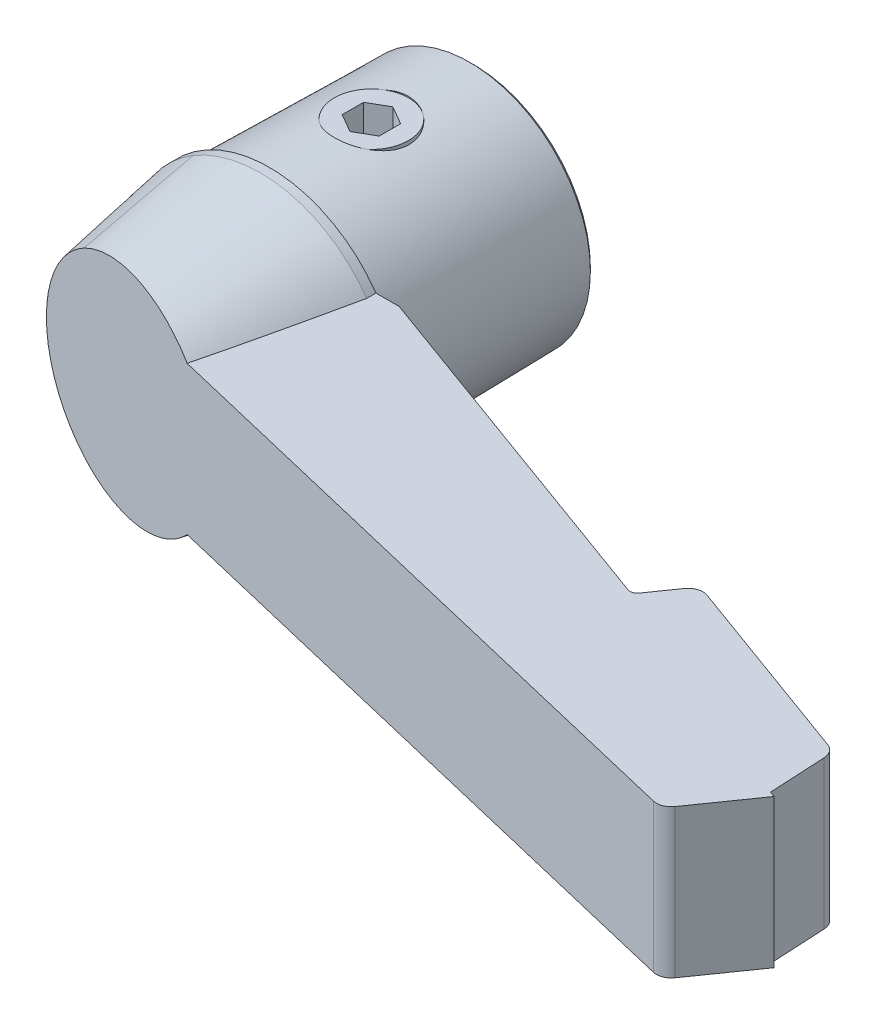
ISO-10303-21;
HEADER;
FILE_DESCRIPTION(('STEP AP214'),'2;1');
FILE_NAME('part.step','',(''),(''),'','','');
FILE_SCHEMA(('AUTOMOTIVE_DESIGN { 1 0 10303 214 1 1 1 1 }'));
ENDSEC;
DATA;
#1=APPLICATION_CONTEXT('core data for automotive mechanical design processes');
#2=APPLICATION_PROTOCOL_DEFINITION('international standard','automotive_design',2000,#1);
#3=PRODUCT_CONTEXT('',#1,'mechanical');
#4=PRODUCT('Part','Part','',(#3));
#5=PRODUCT_RELATED_PRODUCT_CATEGORY('part','',(#4));
#6=PRODUCT_DEFINITION_FORMATION('','',#4);
#7=PRODUCT_DEFINITION_CONTEXT('part definition',#1,'design');
#8=PRODUCT_DEFINITION('design','',#6,#7);
#9=PRODUCT_DEFINITION_SHAPE('','',#8);
#10=(LENGTH_UNIT() NAMED_UNIT(*) SI_UNIT(.MILLI.,.METRE.));
#11=(NAMED_UNIT(*) PLANE_ANGLE_UNIT() SI_UNIT($,.RADIAN.));
#12=(NAMED_UNIT(*) SI_UNIT($,.STERADIAN.) SOLID_ANGLE_UNIT());
#13=UNCERTAINTY_MEASURE_WITH_UNIT(LENGTH_MEASURE(1.E-05),#10,'distance_accuracy_value','');
#14=(GEOMETRIC_REPRESENTATION_CONTEXT(3) GLOBAL_UNCERTAINTY_ASSIGNED_CONTEXT((#13)) GLOBAL_UNIT_ASSIGNED_CONTEXT((#10,
#11,#12)) REPRESENTATION_CONTEXT('',''));
#15=CARTESIAN_POINT('',(0.,0.,0.));
#16=DIRECTION('',(0.,0.,1.));
#17=DIRECTION('',(1.,0.,0.));
#18=AXIS2_PLACEMENT_3D('',#15,#16,#17);
#19=CARTESIAN_POINT('',(0.,10.,5.50000000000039));
#20=DIRECTION('',(0.,-1.,0.));
#21=DIRECTION('',(1.,0.,0.));
#22=AXIS2_PLACEMENT_3D('',#19,#20,#21);
#23=CYLINDRICAL_SURFACE('',#22,2.);
#24=CARTESIAN_POINT('',(-1.45386284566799,6.4173981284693,4.1265798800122));
#25=CARTESIAN_POINT('',(-1.53009563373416,6.40157254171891,4.2072790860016));
#26=CARTESIAN_POINT('',(-1.59962946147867,6.38595932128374,4.29436585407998));
#27=CARTESIAN_POINT('',(-1.72343430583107,6.35700945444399,4.47914650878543));
#28=CARTESIAN_POINT('',(-1.77770432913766,6.34367295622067,4.57684108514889));
#29=CARTESIAN_POINT('',(-1.86943155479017,6.32095916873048,4.78047822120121));
#30=CARTESIAN_POINT('',(-1.90686110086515,6.31158839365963,4.88643401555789));
#31=CARTESIAN_POINT('',(-1.96348969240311,6.29817131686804,5.10342503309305));
#32=CARTESIAN_POINT('',(-1.9826941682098,6.2941234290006,5.21445873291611));
#33=CARTESIAN_POINT('',(-2.00190642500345,6.29207605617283,5.43487152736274));
#34=CARTESIAN_POINT('',(-2.0024717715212,6.29389910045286,5.54420062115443));
#35=CARTESIAN_POINT('',(-1.98584845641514,6.3031356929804,5.76125274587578));
#36=CARTESIAN_POINT('',(-1.96866001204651,6.31054917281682,5.8689757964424));
#37=CARTESIAN_POINT('',(-1.91749670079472,6.33010215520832,6.07854068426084));
#38=CARTESIAN_POINT('',(-1.88371988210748,6.3421855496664,6.18043644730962));
#39=CARTESIAN_POINT('',(-1.80056688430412,6.36985868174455,6.3771357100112));
#40=CARTESIAN_POINT('',(-1.75118753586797,6.38544913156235,6.47193776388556));
#41=CARTESIAN_POINT('',(-1.63601047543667,6.41925436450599,6.6557150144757));
#42=CARTESIAN_POINT('',(-1.56965438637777,6.43754701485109,6.74432591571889));
#43=CARTESIAN_POINT('',(-1.42329350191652,6.47442942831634,6.90940032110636));
#44=CARTESIAN_POINT('',(-1.34328559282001,6.49301925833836,6.98586104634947));
#45=CARTESIAN_POINT('',(-1.16879450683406,6.52922367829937,7.12692961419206));
#46=CARTESIAN_POINT('',(-1.07393060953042,6.54678815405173,7.19108087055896));
#47=CARTESIAN_POINT('',(-0.874196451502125,6.57839669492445,7.30245615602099));
#48=CARTESIAN_POINT('',(-0.769327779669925,6.59244131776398,7.34968286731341));
#49=CARTESIAN_POINT('',(-0.554862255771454,6.61522142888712,7.42477429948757));
#50=CARTESIAN_POINT('',(-0.445414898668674,6.62406424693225,7.45303227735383));
#51=CARTESIAN_POINT('',(-0.223027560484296,6.63593094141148,7.49072033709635));
#52=CARTESIAN_POINT('',(-0.110088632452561,6.63895655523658,7.50015604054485));
#53=CARTESIAN_POINT('',(0.11102604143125,6.63885880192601,7.49984656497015));
#54=CARTESIAN_POINT('',(0.219203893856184,6.63598675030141,7.4908853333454));
#55=CARTESIAN_POINT('',(0.432417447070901,6.62489488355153,7.45568148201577));
#56=CARTESIAN_POINT('',(0.537453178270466,6.6166751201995,7.42943902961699));
#57=CARTESIAN_POINT('',(0.741282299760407,6.59573994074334,7.36065801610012));
#58=CARTESIAN_POINT('',(0.840089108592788,6.58303460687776,7.3181559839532));
#59=CARTESIAN_POINT('',(1.02927496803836,6.55435354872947,7.21815253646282));
#60=CARTESIAN_POINT('',(1.11965224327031,6.53837713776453,7.16064797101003));
#61=CARTESIAN_POINT('',(1.29327532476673,6.50397754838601,7.0296182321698));
#62=CARTESIAN_POINT('',(1.37609507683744,6.4854823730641,6.95554727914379));
#63=CARTESIAN_POINT('',(1.5283685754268,6.44841290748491,6.79474195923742));
#64=CARTESIAN_POINT('',(1.59781920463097,6.42983859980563,6.70800464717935));
#65=CARTESIAN_POINT('',(1.72332180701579,6.39399055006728,6.52135220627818));
#66=CARTESIAN_POINT('',(1.77893826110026,6.37676858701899,6.42113327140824));
#67=CARTESIAN_POINT('',(1.87240205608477,6.34615359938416,6.21218050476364));
#68=CARTESIAN_POINT('',(1.91025331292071,6.33275973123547,6.10344855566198));
#69=CARTESIAN_POINT('',(1.96609721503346,6.3116206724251,5.88342286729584));
#70=CARTESIAN_POINT('',(1.98456968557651,6.3037406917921,5.77226427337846));
#71=CARTESIAN_POINT('',(2.00257443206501,6.29394078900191,5.548175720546));
#72=CARTESIAN_POINT('',(2.00211216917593,6.2920191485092,5.43524628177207));
#73=CARTESIAN_POINT('',(1.98263795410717,6.29416396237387,5.21577322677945));
#74=CARTESIAN_POINT('',(1.96439107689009,6.29798695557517,5.10915821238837));
#75=CARTESIAN_POINT('',(1.91108089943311,6.31056186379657,4.90053024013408));
#76=CARTESIAN_POINT('',(1.87601643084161,6.31931412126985,4.79851760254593));
#77=CARTESIAN_POINT('',(1.78986782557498,6.34067210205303,4.60107830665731));
#78=CARTESIAN_POINT('',(1.73867128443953,6.35330484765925,4.50570377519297));
#79=CARTESIAN_POINT('',(1.62178618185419,6.38088019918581,4.32465901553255));
#80=CARTESIAN_POINT('',(1.5560942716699,6.39582333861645,4.23899103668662));
#81=CARTESIAN_POINT('',(1.40890724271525,6.42697226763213,4.07609084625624));
#82=CARTESIAN_POINT('',(1.32687427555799,6.44320470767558,3.99934902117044));
#83=CARTESIAN_POINT('',(1.15098662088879,6.47447491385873,3.86055458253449));
#84=CARTESIAN_POINT('',(1.05713089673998,6.48951257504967,3.7985032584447));
#85=CARTESIAN_POINT('',(0.85889819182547,6.5168202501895,3.69025280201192));
#86=CARTESIAN_POINT('',(0.754415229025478,6.52905741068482,3.64423882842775));
#87=CARTESIAN_POINT('',(0.538767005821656,6.54908593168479,3.57056900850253));
#88=CARTESIAN_POINT('',(0.427603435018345,6.55687841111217,3.54290854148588));
#89=CARTESIAN_POINT('',(0.205537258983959,6.56691260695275,3.50751604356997));
#90=CARTESIAN_POINT('',(0.0947387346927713,6.56932293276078,3.49917834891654));
#91=CARTESIAN_POINT('',(-0.12669182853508,6.56881446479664,3.50094927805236));
#92=CARTESIAN_POINT('',(-0.237323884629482,6.56589626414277,3.51105584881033));
#93=CARTESIAN_POINT('',(-0.452724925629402,6.55519215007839,3.54891389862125));
#94=CARTESIAN_POINT('',(-0.557569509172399,6.54751554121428,3.5762693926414));
#95=CARTESIAN_POINT('',(-0.761152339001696,6.52823199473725,3.64736030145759));
#96=CARTESIAN_POINT('',(-0.859890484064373,6.51662499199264,3.69109598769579));
#97=CARTESIAN_POINT('',(-1.04720922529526,6.49093447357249,3.79280194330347));
#98=CARTESIAN_POINT('',(-1.13593137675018,6.47689532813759,3.85052352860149));
#99=CARTESIAN_POINT('',(-1.30307053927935,6.44763981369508,3.97910273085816));
#100=CARTESIAN_POINT('',(-1.38148590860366,6.43242325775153,4.04996243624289));
#101=CARTESIAN_POINT('',(-1.45386284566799,6.4173981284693,4.1265798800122));
#102=B_SPLINE_CURVE_WITH_KNOTS('',3,(#24,#25,#26,#27,#28,#29,#30,#31,#32,#33,#34,#35,#36,#37,
#38,#39,#40,#41,#42,#43,#44,#45,#46,#47,#48,#49,#50,#51,#52,#53,#54,#55,#56,#57,#58,#59,#60,#61,
#62,#63,#64,#65,#66,#67,#68,#69,#70,#71,#72,#73,#74,#75,#76,#77,#78,#79,#80,#81,#82,#83,#84,#85,
#86,#87,#88,#89,#90,#91,#92,#93,#94,#95,#96,#97,#98,#99,#100,#101),.UNSPECIFIED.,.T.,.F.,(4,2,2,
2,2,2,2,2,2,2,2,2,2,2,2,2,2,2,2,2,2,2,2,2,2,2,2,2,2,2,2,2,2,2,2,2,2,2,4),(0.,0.336041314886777,
0.672104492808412,1.00871757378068,1.34523032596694,1.67166729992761,1.99810027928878,
2.32072739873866,2.64342009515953,2.97852271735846,3.31370187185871,3.65958670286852,
4.00541669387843,4.34383518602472,4.68215258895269,5.00635273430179,5.33054974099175,
5.65402263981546,5.97756351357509,6.31396008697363,6.65043500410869,6.99644603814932,
7.3423807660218,7.67953190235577,8.01658579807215,8.33975229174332,8.66294123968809,
8.98843383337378,9.3140017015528,9.65292863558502,9.99188530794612,10.3346349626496,
10.6772982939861,11.0090666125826,11.340798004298,11.6651780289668,11.9895634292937,
12.3085570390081,12.6276013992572),.UNSPECIFIED.);
#103=CARTESIAN_POINT('',(-1.30850623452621,6.5,7.0125512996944));
#104=VERTEX_POINT('',#103);
#105=CARTESIAN_POINT('',(1.3085062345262,6.5,7.01255129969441));
#106=VERTEX_POINT('',#105);
#107=EDGE_CURVE('E279',#104,#106,#102,.T.);
#108=ORIENTED_EDGE('',*,*,#107,.T.);
#109=CARTESIAN_POINT('',(0.,6.5,5.50000000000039));
#110=DIRECTION('',(0.,-1.,0.));
#111=DIRECTION('',(0.,0.,-1.));
#112=AXIS2_PLACEMENT_3D('',#109,#110,#111);
#113=CIRCLE('',#112,2.);
#114=EDGE_CURVE('E9',#106,#104,#113,.T.);
#115=ORIENTED_EDGE('',*,*,#114,.T.);
#116=EDGE_LOOP('',(#108,#115));
#117=FACE_BOUND('',#116,.T.);
#118=ADVANCED_FACE('F15',(#117),#23,.F.);
#119=CARTESIAN_POINT('',(0.980742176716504,6.50000000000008,3.7569725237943));
#120=VERTEX_POINT('',#119);
#121=CARTESIAN_POINT('',(-0.980742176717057,6.5,3.75697252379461));
#122=VERTEX_POINT('',#121);
#123=EDGE_CURVE('E419',#120,#122,#102,.T.);
#124=ORIENTED_EDGE('',*,*,#123,.T.);
#125=EDGE_CURVE('E24',#122,#120,#113,.T.);
#126=ORIENTED_EDGE('',*,*,#125,.T.);
#127=EDGE_LOOP('',(#124,#126));
#128=FACE_BOUND('',#127,.T.);
#129=ADVANCED_FACE('F302',(#128),#23,.F.);
#130=CARTESIAN_POINT('',(0.,0.,11.5000000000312));
#131=DIRECTION('',(0.,0.,-1.));
#132=DIRECTION('',(1.,0.,0.));
#133=AXIS2_PLACEMENT_3D('',#130,#131,#132);
#134=CONICAL_SURFACE('',#133,7.,0.174532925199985);
#135=CARTESIAN_POINT('',(-0.243187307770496,0.,18.379183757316));
#136=DIRECTION('',(0.231831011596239,0.,-0.972756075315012));
#137=DIRECTION('',(-0.972756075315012,0.,-0.231831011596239));
#138=AXIS2_PLACEMENT_3D('',#135,#136,#137);
#139=ELLIPSE('',#138,5.94909088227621,5.78190231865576);
#140=CARTESIAN_POINT('',(-3.36427193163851,-4.86892466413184,17.6353547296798));
#141=VERTEX_POINT('',#140);
#142=CARTESIAN_POINT('',(3.9354763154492,-4.,19.3750591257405));
#143=VERTEX_POINT('',#142);
#144=EDGE_CURVE('E476',#141,#143,#139,.F.);
#145=ORIENTED_EDGE('',*,*,#144,.F.);
#146=CARTESIAN_POINT('',(4.02455846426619E-13,-16.2270468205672,-44.3840611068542));
#147=DIRECTION('',(0.,0.983640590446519,-0.180142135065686));
#148=DIRECTION('',(0.,-0.180142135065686,-0.983640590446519));
#149=AXIS2_PLACEMENT_3D('',#146,#147,#148);
#150=ELLIPSE('',#149,93.5587210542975,4.55365898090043);
#151=CARTESIAN_POINT('',(-3.61793269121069,-5.99254228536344,11.5000000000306));
#152=VERTEX_POINT('',#151);
#153=EDGE_CURVE('E482',#141,#152,#150,.F.);
#154=ORIENTED_EDGE('',*,*,#153,.T.);
#155=CARTESIAN_POINT('',(0.,0.,11.5000000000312));
#156=DIRECTION('',(0.,0.,-1.));
#157=DIRECTION('',(1.,0.,0.));
#158=AXIS2_PLACEMENT_3D('',#155,#156,#157);
#159=CIRCLE('',#158,7.);
#160=CARTESIAN_POINT('',(5.744562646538,-4.,11.5000000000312));
#161=VERTEX_POINT('',#160);
#162=EDGE_CURVE('E408',#161,#152,#159,.T.);
#163=ORIENTED_EDGE('',*,*,#162,.F.);
#164=CARTESIAN_POINT('',(7.59735998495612,-4.,2.5051876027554));
#165=CARTESIAN_POINT('',(7.4138483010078,-4.,3.4258427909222));
#166=CARTESIAN_POINT('',(7.2290402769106,-4.,4.34624303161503));
#167=CARTESIAN_POINT('',(6.85591003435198,-4.,6.18642018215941));
#168=CARTESIAN_POINT('',(6.66758748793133,-4.,7.106197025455));
#169=CARTESIAN_POINT('',(6.28516613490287,-4.,8.95147412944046));
#170=CARTESIAN_POINT('',(6.09103545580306,-4.,9.87696780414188));
#171=CARTESIAN_POINT('',(5.69687738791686,-4.,11.7266283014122));
#172=CARTESIAN_POINT('',(5.49685044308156,-4.,12.6507952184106));
#173=CARTESIAN_POINT('',(5.08883121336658,-4.,14.4969857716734));
#174=CARTESIAN_POINT('',(4.88084221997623,-4.,15.419010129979));
#175=CARTESIAN_POINT('',(4.56008831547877,-4.,16.8001255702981));
#176=CARTESIAN_POINT('',(4.45169533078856,-4.,17.2602312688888));
#177=CARTESIAN_POINT('',(4.23128234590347,-4.,18.1795671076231));
#178=CARTESIAN_POINT('',(4.11926240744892,-4.,18.6387972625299));
#179=CARTESIAN_POINT('',(3.89119587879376,-4.,19.5539653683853));
#180=CARTESIAN_POINT('',(3.77517072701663,-4.,20.0099086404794));
#181=CARTESIAN_POINT('',(3.53724101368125,-4.,20.9202979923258));
#182=CARTESIAN_POINT('',(3.41533603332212,-4.,21.37474396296));
#183=CARTESIAN_POINT('',(3.16368238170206,-4.,22.2813458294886));
#184=CARTESIAN_POINT('',(3.03393594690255,-4.,22.733502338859));
#185=CARTESIAN_POINT('',(2.83087656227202,-4.,23.409173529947));
#186=CARTESIAN_POINT('',(2.76178783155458,-4.,23.6339567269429));
#187=CARTESIAN_POINT('',(2.62012637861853,-4.,24.0824197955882));
#188=CARTESIAN_POINT('',(2.54755377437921,-4.,24.3060997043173));
#189=CARTESIAN_POINT('',(2.39777866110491,-4.,24.7527504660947));
#190=CARTESIAN_POINT('',(2.32056133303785,-4.,24.9757163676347));
#191=CARTESIAN_POINT('',(2.16043860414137,-4.,25.4195248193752));
#192=CARTESIAN_POINT('',(2.07753540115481,-4.,25.6403681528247));
#193=CARTESIAN_POINT('',(1.94723693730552,-4.,25.9695897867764));
#194=CARTESIAN_POINT('',(1.9027561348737,-4.,26.079120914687));
#195=CARTESIAN_POINT('',(1.81144563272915,-4.,26.2971882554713));
#196=CARTESIAN_POINT('',(1.76461619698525,-4.,26.405724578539));
#197=CARTESIAN_POINT('',(1.66806414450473,-4.,26.6216704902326));
#198=CARTESIAN_POINT('',(1.61833812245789,-4.,26.7290785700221));
#199=CARTESIAN_POINT('',(1.51527033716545,-4.,26.9421910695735));
#200=CARTESIAN_POINT('',(1.46192718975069,-4.,27.0478948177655));
#201=CARTESIAN_POINT('',(1.40640735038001,-4.,27.1524825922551));
#202=B_SPLINE_CURVE_WITH_KNOTS('',3,(#164,#165,#166,#167,#168,#169,#170,#171,#172,#173,#174,
#175,#176,#177,#178,#179,#180,#181,#182,#183,#184,#185,#186,#187,#188,#189,#190,#191,#192,#193,
#194,#195,#196,#197,#198,#199,#200,#201),.UNSPECIFIED.,.F.,.F.,(4,2,2,2,2,2,2,2,2,2,2,2,2,2,2,2,
2,2,4),(0.,2.81630350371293,5.63287113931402,8.46976043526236,11.3064366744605,14.1419526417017,
15.5600446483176,16.9781125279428,18.3895047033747,19.8009975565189,21.2120897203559,
21.917552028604,22.6229904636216,23.3308131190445,24.0383636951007,24.3929972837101,
24.7475911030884,25.1026105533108,25.4577666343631),.UNSPECIFIED.);
#203=EDGE_CURVE('E389',#143,#161,#202,.F.);
#204=ORIENTED_EDGE('',*,*,#203,.F.);
#205=EDGE_LOOP('',(#145,#154,#163,#204));
#206=FACE_BOUND('',#205,.T.);
#207=ADVANCED_FACE('F381',(#206),#134,.T.);
#208=CARTESIAN_POINT('',(-0.243187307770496,0.,18.379183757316));
#209=DIRECTION('',(0.231831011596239,0.,-0.972756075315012));
#210=DIRECTION('',(-0.972756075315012,0.,-0.231831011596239));
#211=AXIS2_PLACEMENT_3D('',#208,#209,#210);
#212=ELLIPSE('',#211,5.94909088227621,5.78190231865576);
#213=CARTESIAN_POINT('',(3.9354763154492,4.,19.3750591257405));
#214=VERTEX_POINT('',#213);
#215=CARTESIAN_POINT('',(-3.36427193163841,4.86892466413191,17.6353547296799));
#216=VERTEX_POINT('',#215);
#217=EDGE_CURVE('E344',#214,#216,#212,.F.);
#218=ORIENTED_EDGE('',*,*,#217,.F.);
#219=CARTESIAN_POINT('',(7.59735998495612,4.,2.5051876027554));
#220=CARTESIAN_POINT('',(7.4138483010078,4.,3.4258427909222));
#221=CARTESIAN_POINT('',(7.2290402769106,4.,4.34624303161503));
#222=CARTESIAN_POINT('',(6.85591003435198,4.,6.18642018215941));
#223=CARTESIAN_POINT('',(6.66758748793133,4.,7.106197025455));
#224=CARTESIAN_POINT('',(6.28516613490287,4.,8.95147412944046));
#225=CARTESIAN_POINT('',(6.09103545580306,4.,9.87696780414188));
#226=CARTESIAN_POINT('',(5.69687738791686,4.,11.7266283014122));
#227=CARTESIAN_POINT('',(5.49685044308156,4.,12.6507952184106));
#228=CARTESIAN_POINT('',(5.08883121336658,4.,14.4969857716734));
#229=CARTESIAN_POINT('',(4.88084221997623,4.,15.419010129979));
#230=CARTESIAN_POINT('',(4.56008831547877,4.,16.8001255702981));
#231=CARTESIAN_POINT('',(4.45169533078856,4.,17.2602312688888));
#232=CARTESIAN_POINT('',(4.23128234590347,4.,18.1795671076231));
#233=CARTESIAN_POINT('',(4.11926240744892,4.,18.6387972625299));
#234=CARTESIAN_POINT('',(3.89119587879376,4.,19.5539653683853));
#235=CARTESIAN_POINT('',(3.77517072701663,4.,20.0099086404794));
#236=CARTESIAN_POINT('',(3.53724101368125,4.,20.9202979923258));
#237=CARTESIAN_POINT('',(3.41533603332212,4.,21.37474396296));
#238=CARTESIAN_POINT('',(3.16368238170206,4.,22.2813458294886));
#239=CARTESIAN_POINT('',(3.03393594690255,4.,22.733502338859));
#240=CARTESIAN_POINT('',(2.83087656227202,4.,23.409173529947));
#241=CARTESIAN_POINT('',(2.76178783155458,4.,23.6339567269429));
#242=CARTESIAN_POINT('',(2.62012637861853,4.,24.0824197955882));
#243=CARTESIAN_POINT('',(2.54755377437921,4.,24.3060997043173));
#244=CARTESIAN_POINT('',(2.39777866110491,4.,24.7527504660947));
#245=CARTESIAN_POINT('',(2.32056133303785,4.,24.9757163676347));
#246=CARTESIAN_POINT('',(2.16043860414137,4.,25.4195248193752));
#247=CARTESIAN_POINT('',(2.07753540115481,4.,25.6403681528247));
#248=CARTESIAN_POINT('',(1.94723693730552,4.,25.9695897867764));
#249=CARTESIAN_POINT('',(1.9027561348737,4.,26.079120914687));
#250=CARTESIAN_POINT('',(1.81144563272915,4.,26.2971882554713));
#251=CARTESIAN_POINT('',(1.76461619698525,4.,26.405724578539));
#252=CARTESIAN_POINT('',(1.66806414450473,4.,26.6216704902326));
#253=CARTESIAN_POINT('',(1.61833812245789,4.,26.7290785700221));
#254=CARTESIAN_POINT('',(1.51527033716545,4.,26.9421910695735));
#255=CARTESIAN_POINT('',(1.46192718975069,4.,27.0478948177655));
#256=CARTESIAN_POINT('',(1.40640735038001,4.,27.1524825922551));
#257=B_SPLINE_CURVE_WITH_KNOTS('',3,(#219,#220,#221,#222,#223,#224,#225,#226,#227,#228,#229,
#230,#231,#232,#233,#234,#235,#236,#237,#238,#239,#240,#241,#242,#243,#244,#245,#246,#247,#248,
#249,#250,#251,#252,#253,#254,#255,#256),.UNSPECIFIED.,.F.,.F.,(4,2,2,2,2,2,2,2,2,2,2,2,2,2,2,2,
2,2,4),(0.,2.81630350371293,5.63287113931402,8.46976043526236,11.3064366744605,14.1419526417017,
15.5600446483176,16.9781125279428,18.3895047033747,19.8009975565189,21.2120897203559,
21.917552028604,22.6229904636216,23.3308131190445,24.0383636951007,24.3929972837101,
24.7475911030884,25.1026105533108,25.4577666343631),.UNSPECIFIED.);
#258=CARTESIAN_POINT('',(5.744562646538,4.,11.5000000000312));
#259=VERTEX_POINT('',#258);
#260=EDGE_CURVE('E369',#214,#259,#257,.F.);
#261=ORIENTED_EDGE('',*,*,#260,.T.);
#262=CARTESIAN_POINT('',(-3.61793269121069,5.99254228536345,11.5000000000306));
#263=VERTEX_POINT('',#262);
#264=EDGE_CURVE('E407',#263,#259,#159,.T.);
#265=ORIENTED_EDGE('',*,*,#264,.F.);
#266=CARTESIAN_POINT('',(4.9960036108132E-13,16.227046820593,-44.3840611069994));
#267=DIRECTION('',(0.,-0.983640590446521,-0.180142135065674));
#268=DIRECTION('',(0.,0.180142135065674,-0.983640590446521));
#269=AXIS2_PLACEMENT_3D('',#266,#267,#268);
#270=ELLIPSE('',#269,93.5587210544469,4.55365898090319);
#271=EDGE_CURVE('E471',#263,#216,#270,.F.);
#272=ORIENTED_EDGE('',*,*,#271,.T.);
#273=EDGE_LOOP('',(#218,#261,#265,#272));
#274=FACE_BOUND('',#273,.T.);
#275=ADVANCED_FACE('F385',(#274),#134,.T.);
#276=CARTESIAN_POINT('',(0.,0.,0.));
#277=DIRECTION('',(0.,0.,-1.));
#278=DIRECTION('',(1.,0.,0.));
#279=AXIS2_PLACEMENT_3D('',#276,#277,#278);
#280=PLANE('',#279);
#281=DIRECTION('',(0.,1.,0.));
#282=VECTOR('',#281,1.);
#283=CARTESIAN_POINT('',(-2.5,-2.5,0.));
#284=LINE('',#283,#282);
#285=CARTESIAN_POINT('',(-2.5,-2.5,0.));
#286=VERTEX_POINT('',#285);
#287=CARTESIAN_POINT('',(-2.5,2.5,0.));
#288=VERTEX_POINT('',#287);
#289=EDGE_CURVE('E41',#286,#288,#284,.T.);
#290=ORIENTED_EDGE('',*,*,#289,.F.);
#291=DIRECTION('',(1.,0.,0.));
#292=VECTOR('',#291,1.);
#293=CARTESIAN_POINT('',(-2.5,-2.5,0.));
#294=LINE('',#293,#292);
#295=CARTESIAN_POINT('',(2.5,-2.5,0.));
#296=VERTEX_POINT('',#295);
#297=EDGE_CURVE('E447',#286,#296,#294,.T.);
#298=ORIENTED_EDGE('',*,*,#297,.T.);
#299=DIRECTION('',(0.,-1.,0.));
#300=VECTOR('',#299,1.);
#301=CARTESIAN_POINT('',(2.5,2.5,0.));
#302=LINE('',#301,#300);
#303=CARTESIAN_POINT('',(2.5,2.5,0.));
#304=VERTEX_POINT('',#303);
#305=EDGE_CURVE('E1012',#304,#296,#302,.T.);
#306=ORIENTED_EDGE('',*,*,#305,.F.);
#307=DIRECTION('',(-1.,0.,0.));
#308=VECTOR('',#307,1.);
#309=CARTESIAN_POINT('',(2.5,2.5,0.));
#310=LINE('',#309,#308);
#311=EDGE_CURVE('E1011',#304,#288,#310,.T.);
#312=ORIENTED_EDGE('',*,*,#311,.T.);
#313=EDGE_LOOP('',(#290,#298,#306,#312));
#314=FACE_BOUND('',#313,.T.);
#315=CARTESIAN_POINT('',(0.,0.,0.));
#316=DIRECTION('',(0.,0.,-1.));
#317=DIRECTION('',(1.,0.,0.));
#318=AXIS2_PLACEMENT_3D('',#315,#316,#317);
#319=CIRCLE('',#318,6.31148529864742);
#320=CARTESIAN_POINT('',(6.31148529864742,0.,0.));
#321=VERTEX_POINT('',#320);
#322=EDGE_CURVE('E395',#321,#321,#319,.T.);
#323=ORIENTED_EDGE('',*,*,#322,.T.);
#324=EDGE_LOOP('',(#323));
#325=FACE_BOUND('',#324,.T.);
#326=ADVANCED_FACE('F17',(#314,#325),#280,.T.);
#327=CARTESIAN_POINT('',(0.,0.,-2.5));
#328=DIRECTION('',(0.,0.,-1.));
#329=DIRECTION('',(1.,0.,0.));
#330=AXIS2_PLACEMENT_3D('',#327,#328,#329);
#331=CYLINDRICAL_SURFACE('',#330,7.);
#332=DIRECTION('',(0.,0.,-1.));
#333=VECTOR('',#332,1.);
#334=CARTESIAN_POINT('',(5.744562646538,-4.,-2.5));
#335=LINE('',#334,#333);
#336=CARTESIAN_POINT('',(5.744562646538,-4.,11.));
#337=VERTEX_POINT('',#336);
#338=EDGE_CURVE('E377',#161,#337,#335,.T.);
#339=ORIENTED_EDGE('',*,*,#338,.F.);
#340=ORIENTED_EDGE('',*,*,#162,.T.);
#341=CARTESIAN_POINT('',(-7.,0.,11.5000000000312));
#342=VERTEX_POINT('',#341);
#343=EDGE_CURVE('E411',#152,#342,#159,.T.);
#344=ORIENTED_EDGE('',*,*,#343,.T.);
#345=EDGE_CURVE('E599',#342,#263,#159,.T.);
#346=ORIENTED_EDGE('',*,*,#345,.T.);
#347=ORIENTED_EDGE('',*,*,#264,.T.);
#348=DIRECTION('',(0.,0.,-1.));
#349=VECTOR('',#348,1.);
#350=CARTESIAN_POINT('',(5.744562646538,4.,-2.5));
#351=LINE('',#350,#349);
#352=CARTESIAN_POINT('',(5.744562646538,4.,11.));
#353=VERTEX_POINT('',#352);
#354=EDGE_CURVE('E378',#259,#353,#351,.T.);
#355=ORIENTED_EDGE('',*,*,#354,.T.);
#356=CARTESIAN_POINT('',(0.,0.,11.));
#357=DIRECTION('',(0.,0.,-1.));
#358=DIRECTION('',(1.,0.,0.));
#359=AXIS2_PLACEMENT_3D('',#356,#357,#358);
#360=CIRCLE('',#359,7.);
#361=EDGE_CURVE('E404',#337,#353,#360,.T.);
#362=ORIENTED_EDGE('',*,*,#361,.F.);
#363=EDGE_LOOP('',(#339,#340,#344,#346,#347,#355,#362));
#364=FACE_BOUND('',#363,.T.);
#365=ADVANCED_FACE('F387',(#364),#331,.T.);
#366=CARTESIAN_POINT('',(-6.699999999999,0.,11.));
#367=DIRECTION('',(0.,0.,-1.));
#368=DIRECTION('',(1.,0.,0.));
#369=AXIS2_PLACEMENT_3D('',#366,#367,#368);
#370=PLANE('',#369);
#371=CARTESIAN_POINT('',(0.,0.,11.));
#372=DIRECTION('',(0.,0.,-1.));
#373=DIRECTION('',(1.,0.,0.));
#374=AXIS2_PLACEMENT_3D('',#371,#372,#373);
#375=CIRCLE('',#374,6.69999999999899);
#376=CARTESIAN_POINT('',(6.69999999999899,0.,11.));
#377=VERTEX_POINT('',#376);
#378=EDGE_CURVE('E401',#377,#377,#375,.T.);
#379=ORIENTED_EDGE('',*,*,#378,.F.);
#380=EDGE_LOOP('',(#379));
#381=FACE_BOUND('',#380,.T.);
#382=DIRECTION('',(-1.,0.,0.));
#383=VECTOR('',#382,1.);
#384=CARTESIAN_POINT('',(7.,4.,11.));
#385=LINE('',#384,#383);
#386=CARTESIAN_POINT('',(7.,4.,11.));
#387=VERTEX_POINT('',#386);
#388=EDGE_CURVE('E516',#387,#353,#385,.T.);
#389=ORIENTED_EDGE('',*,*,#388,.F.);
#390=DIRECTION('',(0.,1.,0.));
#391=VECTOR('',#390,1.);
#392=CARTESIAN_POINT('',(7.,-4.,11.));
#393=LINE('',#392,#391);
#394=CARTESIAN_POINT('',(7.,-4.,11.));
#395=VERTEX_POINT('',#394);
#396=EDGE_CURVE('E553',#395,#387,#393,.T.);
#397=ORIENTED_EDGE('',*,*,#396,.F.);
#398=DIRECTION('',(-1.,0.,0.));
#399=VECTOR('',#398,1.);
#400=CARTESIAN_POINT('',(7.,-4.,11.));
#401=LINE('',#400,#399);
#402=EDGE_CURVE('E550',#395,#337,#401,.T.);
#403=ORIENTED_EDGE('',*,*,#402,.T.);
#404=ORIENTED_EDGE('',*,*,#361,.T.);
#405=EDGE_LOOP('',(#389,#397,#403,#404));
#406=FACE_BOUND('',#405,.T.);
#407=ADVANCED_FACE('F584',(#381,#406),#370,.T.);
#408=CARTESIAN_POINT('',(0.,0.,0.200000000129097));
#409=DIRECTION('',(0.,0.,1.));
#410=DIRECTION('',(-1.,0.,0.));
#411=AXIS2_PLACEMENT_3D('',#408,#409,#410);
#412=CONICAL_SURFACE('',#411,6.51148529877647,0.0174532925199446);
#413=ORIENTED_EDGE('',*,*,#107,.F.);
#414=EDGE_CURVE('E288',#122,#104,#102,.T.);
#415=ORIENTED_EDGE('',*,*,#414,.F.);
#416=ORIENTED_EDGE('',*,*,#123,.F.);
#417=EDGE_CURVE('E287',#106,#120,#102,.T.);
#418=ORIENTED_EDGE('',*,*,#417,.F.);
#419=EDGE_LOOP('',(#413,#415,#416,#418));
#420=FACE_BOUND('',#419,.T.);
#421=ORIENTED_EDGE('',*,*,#378,.T.);
#422=EDGE_LOOP('',(#421));
#423=FACE_BOUND('',#422,.T.);
#424=CARTESIAN_POINT('',(0.,0.,0.200000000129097));
#425=DIRECTION('',(0.,0.,-1.));
#426=DIRECTION('',(1.,0.,0.));
#427=AXIS2_PLACEMENT_3D('',#424,#425,#426);
#428=CIRCLE('',#427,6.51148529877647);
#429=CARTESIAN_POINT('',(6.51148529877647,0.,0.200000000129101));
#430=VERTEX_POINT('',#429);
#431=EDGE_CURVE('E398',#430,#430,#428,.T.);
#432=ORIENTED_EDGE('',*,*,#431,.F.);
#433=EDGE_LOOP('',(#432));
#434=FACE_BOUND('',#433,.T.);
#435=ADVANCED_FACE('F290',(#420,#423,#434),#412,.T.);
#436=CARTESIAN_POINT('',(0.,0.,0.));
#437=DIRECTION('',(0.,0.,1.));
#438=DIRECTION('',(-1.,0.,0.));
#439=AXIS2_PLACEMENT_3D('',#436,#437,#438);
#440=CONICAL_SURFACE('',#439,6.31148529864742,0.785398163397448);
#441=ORIENTED_EDGE('',*,*,#431,.T.);
#442=EDGE_LOOP('',(#441));
#443=FACE_BOUND('',#442,.T.);
#444=ORIENTED_EDGE('',*,*,#322,.F.);
#445=EDGE_LOOP('',(#444));
#446=FACE_BOUND('',#445,.T.);
#447=ADVANCED_FACE('F887',(#443,#446),#440,.T.);
#448=CARTESIAN_POINT('',(7.,-4.,11.));
#449=DIRECTION('',(-0.342020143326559,0.,0.939692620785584));
#450=DIRECTION('',(-0.939692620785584,0.,-0.342020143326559));
#451=AXIS2_PLACEMENT_3D('',#448,#449,#450);
#452=PLANE('',#451);
#453=DIRECTION('',(0.,1.,0.));
#454=VECTOR('',#453,1.);
#455=CARTESIAN_POINT('',(26.3961255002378,-4.,18.059612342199));
#456=LINE('',#455,#454);
#457=CARTESIAN_POINT('',(26.3961255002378,-4.,18.059612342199));
#458=VERTEX_POINT('',#457);
#459=CARTESIAN_POINT('',(26.3961255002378,4.,18.059612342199));
#460=VERTEX_POINT('',#459);
#461=EDGE_CURVE('E573',#458,#460,#456,.T.);
#462=ORIENTED_EDGE('',*,*,#461,.F.);
#463=DIRECTION('',(0.939692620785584,0.,0.342020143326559));
#464=VECTOR('',#463,1.);
#465=CARTESIAN_POINT('',(7.,-4.,11.));
#466=LINE('',#465,#464);
#467=EDGE_CURVE('E518',#395,#458,#466,.T.);
#468=ORIENTED_EDGE('',*,*,#467,.F.);
#469=ORIENTED_EDGE('',*,*,#396,.T.);
#470=DIRECTION('',(0.939692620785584,0.,0.342020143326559));
#471=VECTOR('',#470,1.);
#472=CARTESIAN_POINT('',(7.,4.,11.));
#473=LINE('',#472,#471);
#474=EDGE_CURVE('E484',#387,#460,#473,.T.);
#475=ORIENTED_EDGE('',*,*,#474,.T.);
#476=EDGE_LOOP('',(#462,#468,#469,#475));
#477=FACE_BOUND('',#476,.T.);
#478=ADVANCED_FACE('F879',(#477),#452,.F.);
#479=CARTESIAN_POINT('',(26.5329335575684,-4.,17.6837352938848));
#480=DIRECTION('',(0.,1.,0.));
#481=DIRECTION('',(-1.,0.,0.));
#482=AXIS2_PLACEMENT_3D('',#479,#480,#481);
#483=CYLINDRICAL_SURFACE('',#482,0.4);
#484=DIRECTION('',(0.,1.,0.));
#485=VECTOR('',#484,1.);
#486=CARTESIAN_POINT('',(26.860594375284,-4.,17.9131658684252));
#487=LINE('',#486,#485);
#488=CARTESIAN_POINT('',(26.860594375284,-4.,17.9131658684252));
#489=VERTEX_POINT('',#488);
#490=CARTESIAN_POINT('',(26.860594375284,4.,17.9131658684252));
#491=VERTEX_POINT('',#490);
#492=EDGE_CURVE('E572',#489,#491,#487,.T.);
#493=ORIENTED_EDGE('',*,*,#492,.F.);
#494=CARTESIAN_POINT('',(26.5329335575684,-4.,17.6837352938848));
#495=DIRECTION('',(0.,-1.,0.));
#496=DIRECTION('',(1.,0.,0.));
#497=AXIS2_PLACEMENT_3D('',#494,#495,#496);
#498=CIRCLE('',#497,0.4);
#499=EDGE_CURVE('E521',#489,#458,#498,.T.);
#500=ORIENTED_EDGE('',*,*,#499,.T.);
#501=ORIENTED_EDGE('',*,*,#461,.T.);
#502=CARTESIAN_POINT('',(26.5329335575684,4.,17.6837352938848));
#503=DIRECTION('',(0.,-1.,0.));
#504=DIRECTION('',(1.,0.,0.));
#505=AXIS2_PLACEMENT_3D('',#502,#503,#504);
#506=CIRCLE('',#505,0.4);
#507=EDGE_CURVE('E487',#491,#460,#506,.T.);
#508=ORIENTED_EDGE('',*,*,#507,.F.);
#509=EDGE_LOOP('',(#493,#500,#501,#508));
#510=FACE_BOUND('',#509,.T.);
#511=ADVANCED_FACE('F870',(#510),#483,.F.);
#512=CARTESIAN_POINT('',(27.8653158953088,-4.,16.4782748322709));
#513=DIRECTION('',(-0.819152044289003,0.,-0.573576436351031));
#514=DIRECTION('',(0.573576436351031,0.,-0.819152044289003));
#515=AXIS2_PLACEMENT_3D('',#512,#513,#514);
#516=PLANE('',#515);
#517=DIRECTION('',(0.,1.,0.));
#518=VECTOR('',#517,1.);
#519=CARTESIAN_POINT('',(27.8653158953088,-4.,16.4782748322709));
#520=LINE('',#519,#518);
#521=CARTESIAN_POINT('',(27.8653158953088,-4.,16.4782748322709));
#522=VERTEX_POINT('',#521);
#523=CARTESIAN_POINT('',(27.8653158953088,4.,16.4782748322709));
#524=VERTEX_POINT('',#523);
#525=EDGE_CURVE('E570',#522,#524,#520,.T.);
#526=ORIENTED_EDGE('',*,*,#525,.F.);
#527=DIRECTION('',(-0.573576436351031,0.,0.819152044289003));
#528=VECTOR('',#527,1.);
#529=CARTESIAN_POINT('',(27.8653158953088,-4.,16.4782748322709));
#530=LINE('',#529,#528);
#531=EDGE_CURVE('E524',#522,#489,#530,.T.);
#532=ORIENTED_EDGE('',*,*,#531,.T.);
#533=ORIENTED_EDGE('',*,*,#492,.T.);
#534=DIRECTION('',(-0.573576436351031,0.,0.819152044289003));
#535=VECTOR('',#534,1.);
#536=CARTESIAN_POINT('',(27.8653158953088,4.,16.4782748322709));
#537=LINE('',#536,#535);
#538=EDGE_CURVE('E490',#524,#491,#537,.T.);
#539=ORIENTED_EDGE('',*,*,#538,.F.);
#540=EDGE_LOOP('',(#526,#532,#533,#539));
#541=FACE_BOUND('',#540,.T.);
#542=ADVANCED_FACE('F861',(#541),#516,.T.);
#543=CARTESIAN_POINT('',(28.52063753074,-4.,16.9371359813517));
#544=DIRECTION('',(0.,1.,0.));
#545=DIRECTION('',(-1.,0.,0.));
#546=AXIS2_PLACEMENT_3D('',#543,#544,#545);
#547=CYLINDRICAL_SURFACE('',#546,0.8);
#548=DIRECTION('',(0.,1.,0.));
#549=VECTOR('',#548,1.);
#550=CARTESIAN_POINT('',(28.7942536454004,-4.,16.185381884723));
#551=LINE('',#550,#549);
#552=CARTESIAN_POINT('',(28.7942536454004,-4.,16.185381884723));
#553=VERTEX_POINT('',#552);
#554=CARTESIAN_POINT('',(28.7942536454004,4.,16.185381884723));
#555=VERTEX_POINT('',#554);
#556=EDGE_CURVE('E568',#553,#555,#551,.T.);
#557=ORIENTED_EDGE('',*,*,#556,.F.);
#558=CARTESIAN_POINT('',(28.52063753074,-4.,16.9371359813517));
#559=DIRECTION('',(0.,-1.,0.));
#560=DIRECTION('',(1.,0.,0.));
#561=AXIS2_PLACEMENT_3D('',#558,#559,#560);
#562=CIRCLE('',#561,0.8);
#563=EDGE_CURVE('E527',#522,#553,#562,.T.);
#564=ORIENTED_EDGE('',*,*,#563,.F.);
#565=ORIENTED_EDGE('',*,*,#525,.T.);
#566=CARTESIAN_POINT('',(28.52063753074,4.,16.9371359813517));
#567=DIRECTION('',(0.,-1.,0.));
#568=DIRECTION('',(1.,0.,0.));
#569=AXIS2_PLACEMENT_3D('',#566,#567,#568);
#570=CIRCLE('',#569,0.8);
#571=EDGE_CURVE('E493',#524,#555,#570,.T.);
#572=ORIENTED_EDGE('',*,*,#571,.T.);
#573=EDGE_LOOP('',(#557,#564,#565,#572));
#574=FACE_BOUND('',#573,.T.);
#575=ADVANCED_FACE('F852',(#574),#547,.T.);
#576=CARTESIAN_POINT('',(39.0148011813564,-4.,19.9053569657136));
#577=DIRECTION('',(0.342020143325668,0.,-0.939692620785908));
#578=DIRECTION('',(0.939692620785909,0.,0.342020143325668));
#579=AXIS2_PLACEMENT_3D('',#576,#577,#578);
#580=PLANE('',#579);
#581=DIRECTION('',(0.,1.,0.));
#582=VECTOR('',#581,1.);
#583=CARTESIAN_POINT('',(39.0148011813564,-4.,19.9053569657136));
#584=LINE('',#583,#582);
#585=CARTESIAN_POINT('',(39.0148011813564,-4.,19.9053569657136));
#586=VERTEX_POINT('',#585);
#587=CARTESIAN_POINT('',(39.0148011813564,4.,19.9053569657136));
#588=VERTEX_POINT('',#587);
#589=EDGE_CURVE('E566',#586,#588,#584,.T.);
#590=ORIENTED_EDGE('',*,*,#589,.F.);
#591=DIRECTION('',(-0.939692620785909,0.,-0.342020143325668));
#592=VECTOR('',#591,1.);
#593=CARTESIAN_POINT('',(39.0148011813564,-4.,19.9053569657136));
#594=LINE('',#593,#592);
#595=EDGE_CURVE('E530',#586,#553,#594,.T.);
#596=ORIENTED_EDGE('',*,*,#595,.T.);
#597=ORIENTED_EDGE('',*,*,#556,.T.);
#598=DIRECTION('',(-0.939692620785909,0.,-0.342020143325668));
#599=VECTOR('',#598,1.);
#600=CARTESIAN_POINT('',(39.0148011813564,4.,19.9053569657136));
#601=LINE('',#600,#599);
#602=EDGE_CURVE('E496',#588,#555,#601,.T.);
#603=ORIENTED_EDGE('',*,*,#602,.F.);
#604=EDGE_LOOP('',(#590,#596,#597,#603));
#605=FACE_BOUND('',#604,.T.);
#606=ADVANCED_FACE('F843',(#605),#580,.T.);
#607=CARTESIAN_POINT('',(38.7411850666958,-4.,20.6571110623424));
#608=DIRECTION('',(0.,1.,0.));
#609=DIRECTION('',(-1.,0.,0.));
#610=AXIS2_PLACEMENT_3D('',#607,#608,#609);
#611=CYLINDRICAL_SURFACE('',#610,0.8);
#612=DIRECTION('',(0.,1.,0.));
#613=VECTOR('',#612,1.);
#614=CARTESIAN_POINT('',(39.5400886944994,-4.,20.6152422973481));
#615=LINE('',#614,#613);
#616=CARTESIAN_POINT('',(39.5400886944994,-4.,20.6152422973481));
#617=VERTEX_POINT('',#616);
#618=CARTESIAN_POINT('',(39.5400886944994,4.,20.6152422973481));
#619=VERTEX_POINT('',#618);
#620=EDGE_CURVE('E564',#617,#619,#615,.T.);
#621=ORIENTED_EDGE('',*,*,#620,.F.);
#622=CARTESIAN_POINT('',(38.7411850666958,-4.,20.6571110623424));
#623=DIRECTION('',(0.,-1.,0.));
#624=DIRECTION('',(1.,0.,0.));
#625=AXIS2_PLACEMENT_3D('',#622,#623,#624);
#626=CIRCLE('',#625,0.8);
#627=EDGE_CURVE('E533',#586,#617,#626,.T.);
#628=ORIENTED_EDGE('',*,*,#627,.F.);
#629=ORIENTED_EDGE('',*,*,#589,.T.);
#630=CARTESIAN_POINT('',(38.7411850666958,4.,20.6571110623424));
#631=DIRECTION('',(0.,-1.,0.));
#632=DIRECTION('',(1.,0.,0.));
#633=AXIS2_PLACEMENT_3D('',#630,#631,#632);
#634=CIRCLE('',#633,0.8);
#635=EDGE_CURVE('E499',#588,#619,#634,.T.);
#636=ORIENTED_EDGE('',*,*,#635,.T.);
#637=EDGE_LOOP('',(#621,#628,#629,#636));
#638=FACE_BOUND('',#637,.T.);
#639=ADVANCED_FACE('F834',(#638),#611,.T.);
#640=CARTESIAN_POINT('',(39.6999999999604,-4.,23.6665317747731));
#641=DIRECTION('',(0.998629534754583,0.,-0.0523359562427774));
#642=DIRECTION('',(0.0523359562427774,0.,0.998629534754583));
#643=AXIS2_PLACEMENT_3D('',#640,#641,#642);
#644=PLANE('',#643);
#645=DIRECTION('',(0.,1.,0.));
#646=VECTOR('',#645,1.);
#647=CARTESIAN_POINT('',(39.6999999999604,-4.,23.6665317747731));
#648=LINE('',#647,#646);
#649=CARTESIAN_POINT('',(39.6999999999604,-4.,23.6665317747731));
#650=VERTEX_POINT('',#649);
#651=CARTESIAN_POINT('',(39.6999999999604,4.,23.6665317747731));
#652=VERTEX_POINT('',#651);
#653=EDGE_CURVE('E562',#650,#652,#648,.T.);
#654=ORIENTED_EDGE('',*,*,#653,.F.);
#655=DIRECTION('',(-0.0523359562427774,0.,-0.998629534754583));
#656=VECTOR('',#655,1.);
#657=CARTESIAN_POINT('',(39.6999999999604,-4.,23.6665317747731));
#658=LINE('',#657,#656);
#659=EDGE_CURVE('E536',#650,#617,#658,.T.);
#660=ORIENTED_EDGE('',*,*,#659,.T.);
#661=ORIENTED_EDGE('',*,*,#620,.T.);
#662=DIRECTION('',(-0.0523359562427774,0.,-0.998629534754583));
#663=VECTOR('',#662,1.);
#664=CARTESIAN_POINT('',(39.6999999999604,4.,23.6665317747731));
#665=LINE('',#664,#663);
#666=EDGE_CURVE('E502',#652,#619,#665,.T.);
#667=ORIENTED_EDGE('',*,*,#666,.F.);
#668=EDGE_LOOP('',(#654,#660,#661,#667));
#669=FACE_BOUND('',#668,.T.);
#670=ADVANCED_FACE('F825',(#669),#644,.T.);
#671=CARTESIAN_POINT('',(39.6999999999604,-4.,23.6665317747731));
#672=DIRECTION('',(-0.342030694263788,0.,0.939688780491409));
#673=DIRECTION('',(-0.939688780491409,0.,-0.342030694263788));
#674=AXIS2_PLACEMENT_3D('',#671,#672,#673);
#675=PLANE('',#674);
#676=DIRECTION('',(0.,1.,0.));
#677=VECTOR('',#676,1.);
#678=CARTESIAN_POINT('',(40.,-4.,23.7757266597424));
#679=LINE('',#678,#677);
#680=CARTESIAN_POINT('',(40.,-4.,23.7757266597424));
#681=VERTEX_POINT('',#680);
#682=CARTESIAN_POINT('',(40.,4.,23.7757266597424));
#683=VERTEX_POINT('',#682);
#684=EDGE_CURVE('E560',#681,#683,#679,.T.);
#685=ORIENTED_EDGE('',*,*,#684,.F.);
#686=DIRECTION('',(0.939688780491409,0.,0.342030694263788));
#687=VECTOR('',#686,1.);
#688=CARTESIAN_POINT('',(39.6999999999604,-4.,23.6665317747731));
#689=LINE('',#688,#687);
#690=EDGE_CURVE('E539',#650,#681,#689,.T.);
#691=ORIENTED_EDGE('',*,*,#690,.F.);
#692=ORIENTED_EDGE('',*,*,#653,.T.);
#693=DIRECTION('',(0.939688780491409,0.,0.342030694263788));
#694=VECTOR('',#693,1.);
#695=CARTESIAN_POINT('',(39.6999999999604,4.,23.6665317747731));
#696=LINE('',#695,#694);
#697=EDGE_CURVE('E505',#652,#683,#696,.T.);
#698=ORIENTED_EDGE('',*,*,#697,.T.);
#699=EDGE_LOOP('',(#685,#691,#692,#698));
#700=FACE_BOUND('',#699,.T.);
#701=ADVANCED_FACE('F816',(#700),#675,.F.);
#702=CARTESIAN_POINT('',(37.7949542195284,-4.,26.9248583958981));
#703=DIRECTION('',(0.819152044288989,0.,0.57357643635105));
#704=DIRECTION('',(-0.57357643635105,0.,0.819152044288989));
#705=AXIS2_PLACEMENT_3D('',#702,#703,#704);
#706=PLANE('',#705);
#707=DIRECTION('',(0.,1.,0.));
#708=VECTOR('',#707,1.);
#709=CARTESIAN_POINT('',(37.7949542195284,-4.,26.9248583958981));
#710=LINE('',#709,#708);
#711=CARTESIAN_POINT('',(37.7949542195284,-4.,26.9248583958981));
#712=VERTEX_POINT('',#711);
#713=CARTESIAN_POINT('',(37.7949542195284,4.,26.9248583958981));
#714=VERTEX_POINT('',#713);
#715=EDGE_CURVE('E558',#712,#714,#710,.T.);
#716=ORIENTED_EDGE('',*,*,#715,.F.);
#717=DIRECTION('',(0.57357643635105,0.,-0.819152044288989));
#718=VECTOR('',#717,1.);
#719=CARTESIAN_POINT('',(37.7949542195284,-4.,26.9248583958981));
#720=LINE('',#719,#718);
#721=EDGE_CURVE('E542',#712,#681,#720,.T.);
#722=ORIENTED_EDGE('',*,*,#721,.T.);
#723=ORIENTED_EDGE('',*,*,#684,.T.);
#724=DIRECTION('',(0.57357643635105,0.,-0.819152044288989));
#725=VECTOR('',#724,1.);
#726=CARTESIAN_POINT('',(37.7949542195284,4.,26.9248583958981));
#727=LINE('',#726,#725);
#728=EDGE_CURVE('E508',#714,#683,#727,.T.);
#729=ORIENTED_EDGE('',*,*,#728,.F.);
#730=EDGE_LOOP('',(#716,#722,#723,#729));
#731=FACE_BOUND('',#730,.T.);
#732=ADVANCED_FACE('F808',(#731),#706,.T.);
#733=CARTESIAN_POINT('',(37.139632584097,-4.,26.4659972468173));
#734=DIRECTION('',(0.,1.,0.));
#735=DIRECTION('',(-1.,0.,0.));
#736=AXIS2_PLACEMENT_3D('',#733,#734,#735);
#737=CYLINDRICAL_SURFACE('',#736,0.799999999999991);
#738=DIRECTION('',(0.,1.,0.));
#739=VECTOR('',#738,1.);
#740=CARTESIAN_POINT('',(36.95416777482,-4.,27.2442021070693));
#741=LINE('',#740,#739);
#742=CARTESIAN_POINT('',(36.95416777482,-4.,27.2442021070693));
#743=VERTEX_POINT('',#742);
#744=CARTESIAN_POINT('',(36.95416777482,4.,27.2442021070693));
#745=VERTEX_POINT('',#744);
#746=EDGE_CURVE('E555',#743,#745,#741,.T.);
#747=ORIENTED_EDGE('',*,*,#746,.F.);
#748=CARTESIAN_POINT('',(37.139632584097,-4.,26.4659972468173));
#749=DIRECTION('',(0.,-1.,0.));
#750=DIRECTION('',(1.,0.,0.));
#751=AXIS2_PLACEMENT_3D('',#748,#749,#750);
#752=CIRCLE('',#751,0.799999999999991);
#753=EDGE_CURVE('E545',#712,#743,#752,.T.);
#754=ORIENTED_EDGE('',*,*,#753,.F.);
#755=ORIENTED_EDGE('',*,*,#715,.T.);
#756=CARTESIAN_POINT('',(37.139632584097,4.,26.4659972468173));
#757=DIRECTION('',(0.,-1.,0.));
#758=DIRECTION('',(1.,0.,0.));
#759=AXIS2_PLACEMENT_3D('',#756,#757,#758);
#760=CIRCLE('',#759,0.799999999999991);
#761=EDGE_CURVE('E511',#714,#745,#760,.T.);
#762=ORIENTED_EDGE('',*,*,#761,.T.);
#763=EDGE_LOOP('',(#747,#754,#755,#762));
#764=FACE_BOUND('',#763,.T.);
#765=ADVANCED_FACE('F604',(#764),#737,.T.);
#766=CARTESIAN_POINT('',(26.5329335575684,-4.,17.6837352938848));
#767=DIRECTION('',(0.,-1.,0.));
#768=DIRECTION('',(1.,0.,0.));
#769=AXIS2_PLACEMENT_3D('',#766,#767,#768);
#770=PLANE('',#769);
#771=DIRECTION('',(0.972756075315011,0.,0.23183101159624));
#772=VECTOR('',#771,1.);
#773=CARTESIAN_POINT('',(-5.51906414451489,-4.,17.1218162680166));
#774=LINE('',#773,#772);
#775=EDGE_CURVE('E548',#143,#743,#774,.T.);
#776=ORIENTED_EDGE('',*,*,#775,.F.);
#777=ORIENTED_EDGE('',*,*,#203,.T.);
#778=ORIENTED_EDGE('',*,*,#338,.T.);
#779=ORIENTED_EDGE('',*,*,#402,.F.);
#780=ORIENTED_EDGE('',*,*,#467,.T.);
#781=ORIENTED_EDGE('',*,*,#499,.F.);
#782=ORIENTED_EDGE('',*,*,#531,.F.);
#783=ORIENTED_EDGE('',*,*,#563,.T.);
#784=ORIENTED_EDGE('',*,*,#595,.F.);
#785=ORIENTED_EDGE('',*,*,#627,.T.);
#786=ORIENTED_EDGE('',*,*,#659,.F.);
#787=ORIENTED_EDGE('',*,*,#690,.T.);
#788=ORIENTED_EDGE('',*,*,#721,.F.);
#789=ORIENTED_EDGE('',*,*,#753,.T.);
#790=EDGE_LOOP('',(#776,#777,#778,#779,#780,#781,#782,#783,#784,#785,#786,#787,#788,#789));
#791=FACE_BOUND('',#790,.T.);
#792=ADVANCED_FACE('F364',(#791),#770,.T.);
#793=CARTESIAN_POINT('',(26.5329335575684,4.,17.6837352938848));
#794=DIRECTION('',(0.,-1.,0.));
#795=DIRECTION('',(1.,0.,0.));
#796=AXIS2_PLACEMENT_3D('',#793,#794,#795);
#797=PLANE('',#796);
#798=ORIENTED_EDGE('',*,*,#260,.F.);
#799=DIRECTION('',(0.972756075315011,0.,0.23183101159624));
#800=VECTOR('',#799,1.);
#801=CARTESIAN_POINT('',(-5.51906414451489,4.,17.1218162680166));
#802=LINE('',#801,#800);
#803=EDGE_CURVE('E514',#214,#745,#802,.T.);
#804=ORIENTED_EDGE('',*,*,#803,.T.);
#805=ORIENTED_EDGE('',*,*,#761,.F.);
#806=ORIENTED_EDGE('',*,*,#728,.T.);
#807=ORIENTED_EDGE('',*,*,#697,.F.);
#808=ORIENTED_EDGE('',*,*,#666,.T.);
#809=ORIENTED_EDGE('',*,*,#635,.F.);
#810=ORIENTED_EDGE('',*,*,#602,.T.);
#811=ORIENTED_EDGE('',*,*,#571,.F.);
#812=ORIENTED_EDGE('',*,*,#538,.T.);
#813=ORIENTED_EDGE('',*,*,#507,.T.);
#814=ORIENTED_EDGE('',*,*,#474,.F.);
#815=ORIENTED_EDGE('',*,*,#388,.T.);
#816=ORIENTED_EDGE('',*,*,#354,.F.);
#817=EDGE_LOOP('',(#798,#804,#805,#806,#807,#808,#809,#810,#811,#812,#813,#814,#815,#816));
#818=FACE_BOUND('',#817,.T.);
#819=ADVANCED_FACE('F355',(#818),#797,.F.);
#820=CARTESIAN_POINT('',(-5.51906414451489,-4.,17.1218162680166));
#821=DIRECTION('',(-0.23183101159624,0.,0.972756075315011));
#822=DIRECTION('',(-0.972756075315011,0.,-0.23183101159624));
#823=AXIS2_PLACEMENT_3D('',#820,#821,#822);
#824=PLANE('',#823);
#825=ORIENTED_EDGE('',*,*,#144,.T.);
#826=ORIENTED_EDGE('',*,*,#775,.T.);
#827=ORIENTED_EDGE('',*,*,#746,.T.);
#828=ORIENTED_EDGE('',*,*,#803,.F.);
#829=ORIENTED_EDGE('',*,*,#217,.T.);
#830=DIRECTION('',(0.971880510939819,-0.0424188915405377,0.231622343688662));
#831=VECTOR('',#830,1.);
#832=CARTESIAN_POINT('',(-3.90410801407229,4.89248645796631,17.506698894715));
#833=LINE('',#832,#831);
#834=CARTESIAN_POINT('',(-3.3559084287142,4.86855962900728,17.6373479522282));
#835=VERTEX_POINT('',#834);
#836=EDGE_CURVE('E410',#216,#835,#833,.T.);
#837=ORIENTED_EDGE('',*,*,#836,.T.);
#838=CARTESIAN_POINT('',(-6.0302016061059,0.,17.));
#839=CARTESIAN_POINT('',(-6.0302001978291,0.118476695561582,17.000000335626));
#840=CARTESIAN_POINT('',(-6.02655120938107,0.23691350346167,17.0008699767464));
#841=CARTESIAN_POINT('',(-6.0119789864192,0.473289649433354,17.0043428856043));
#842=CARTESIAN_POINT('',(-6.00105719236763,0.591229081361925,17.0069458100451));
#843=CARTESIAN_POINT('',(-5.95740796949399,0.943776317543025,17.0173484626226));
#844=CARTESIAN_POINT('',(-5.91379671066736,1.17708176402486,17.0277420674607));
#845=CARTESIAN_POINT('',(-5.81731217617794,1.56090690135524,17.0507366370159));
#846=CARTESIAN_POINT('',(-5.77213293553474,1.71354663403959,17.0615039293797));
#847=CARTESIAN_POINT('',(-5.66939051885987,2.01440838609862,17.0859899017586));
#848=CARTESIAN_POINT('',(-5.61182591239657,2.16262989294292,17.0997089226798));
#849=CARTESIAN_POINT('',(-5.4847427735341,2.45366575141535,17.1299958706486));
#850=CARTESIAN_POINT('',(-5.41521604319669,2.59647631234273,17.1465657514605));
#851=CARTESIAN_POINT('',(-5.26479011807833,2.87562205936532,17.1824158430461));
#852=CARTESIAN_POINT('',(-5.18389084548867,3.01195720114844,17.2016960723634));
#853=CARTESIAN_POINT('',(-5.01115001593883,3.27755633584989,17.2428643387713));
#854=CARTESIAN_POINT('',(-4.9192830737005,3.40680287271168,17.2647584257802));
#855=CARTESIAN_POINT('',(-4.72549787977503,3.65699691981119,17.3109420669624));
#856=CARTESIAN_POINT('',(-4.62358306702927,3.77794724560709,17.3352308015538));
#857=CARTESIAN_POINT('',(-4.41054525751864,4.01072205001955,17.3860028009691));
#858=CARTESIAN_POINT('',(-4.29943119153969,4.12255517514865,17.4124839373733));
#859=CARTESIAN_POINT('',(-4.06875661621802,4.33650694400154,17.4674591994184));
#860=CARTESIAN_POINT('',(-3.9491999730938,4.43862998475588,17.4959524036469));
#861=CARTESIAN_POINT('',(-3.75018581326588,4.59508788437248,17.5433822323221));
#862=CARTESIAN_POINT('',(-3.6730953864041,4.65263407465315,17.5617547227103));
#863=CARTESIAN_POINT('',(-3.5163820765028,4.76364790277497,17.5991032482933));
#864=CARTESIAN_POINT('',(-3.43676384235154,4.81712247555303,17.6180781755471));
#865=CARTESIAN_POINT('',(-3.3559084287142,4.8685596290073,17.6373479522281));
#866=B_SPLINE_CURVE_WITH_KNOTS('',3,(#838,#839,#840,#841,#842,#843,#844,#845,#846,#847,#848,
#849,#850,#851,#852,#853,#854,#855,#856,#857,#858,#859,#860,#861,#862,#863,#864,#865),
.UNSPECIFIED.,.F.,.F.,(4,2,2,2,2,2,2,2,2,2,2,2,2,4),(0.,0.355291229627,0.710512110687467,
1.42104711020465,1.89919866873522,2.37740548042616,2.85594133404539,3.33448046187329,
3.81414948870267,4.29365491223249,4.77270016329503,5.25152744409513,5.54523526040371,
5.83843107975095),.UNSPECIFIED.);
#867=CARTESIAN_POINT('',(-6.0302016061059,0.,17.));
#868=VERTEX_POINT('',#867);
#869=EDGE_CURVE('E329',#868,#835,#866,.T.);
#870=ORIENTED_EDGE('',*,*,#869,.F.);
#871=CARTESIAN_POINT('',(-3.3559084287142,-4.86855962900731,17.6373479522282));
#872=CARTESIAN_POINT('',(-3.45374379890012,-4.80631687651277,17.6140314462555));
#873=CARTESIAN_POINT('',(-3.54975330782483,-4.7411062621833,17.5911500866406));
#874=CARTESIAN_POINT('',(-3.73783299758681,-4.60490283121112,17.5463262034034));
#875=CARTESIAN_POINT('',(-3.8299025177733,-4.53390905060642,17.52438383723));
#876=CARTESIAN_POINT('',(-4.09991867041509,-4.31235413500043,17.4600325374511));
#877=CARTESIAN_POINT('',(-4.27145687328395,-4.15335671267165,17.4191508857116));
#878=CARTESIAN_POINT('',(-4.54376268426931,-3.86829396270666,17.3542539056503));
#879=CARTESIAN_POINT('',(-4.64986052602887,-3.74752594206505,17.3289682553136));
#880=CARTESIAN_POINT('',(-4.85185823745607,-3.49721772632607,17.2808273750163));
#881=CARTESIAN_POINT('',(-4.9477564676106,-3.36767612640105,17.2579725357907));
#882=CARTESIAN_POINT('',(-5.12858972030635,-3.10066273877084,17.2148756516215));
#883=CARTESIAN_POINT('',(-5.21351976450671,-2.96318739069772,17.1946347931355));
#884=CARTESIAN_POINT('',(-5.37168350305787,-2.68130080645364,17.1569405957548));
#885=CARTESIAN_POINT('',(-5.44491750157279,-2.53688975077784,17.1394871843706));
#886=CARTESIAN_POINT('',(-5.5789531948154,-2.24243460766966,17.1075432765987));
#887=CARTESIAN_POINT('',(-5.63977874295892,-2.09240199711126,17.0930470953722));
#888=CARTESIAN_POINT('',(-5.74864441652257,-1.78757482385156,17.0671018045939));
#889=CARTESIAN_POINT('',(-5.79668950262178,-1.63278213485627,17.0556515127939));
#890=CARTESIAN_POINT('',(-5.87956334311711,-1.31971851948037,17.0359006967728));
#891=CARTESIAN_POINT('',(-5.9144088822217,-1.16145228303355,17.0275961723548));
#892=CARTESIAN_POINT('',(-5.97065775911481,-0.842484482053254,17.0141907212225));
#893=CARTESIAN_POINT('',(-5.99206855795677,-0.681784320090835,17.0090880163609));
#894=CARTESIAN_POINT('',(-6.01452219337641,-0.433900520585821,17.0037367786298));
#895=CARTESIAN_POINT('',(-6.02040576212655,-0.34715284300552,17.00233458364));
#896=CARTESIAN_POINT('',(-6.02824257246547,-0.173606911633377,17.0004668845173));
#897=CARTESIAN_POINT('',(-6.03020198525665,-0.086808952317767,16.9999999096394));
#898=CARTESIAN_POINT('',(-6.03020160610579,0.,17.));
#899=B_SPLINE_CURVE_WITH_KNOTS('',3,(#871,#872,#873,#874,#875,#876,#877,#878,#879,#880,#881,
#882,#883,#884,#885,#886,#887,#888,#889,#890,#891,#892,#893,#894,#895,#896,#897,#898),
.UNSPECIFIED.,.F.,.F.,(4,2,2,2,2,2,2,2,2,2,2,2,2,4),(0.,0.35471073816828,0.709480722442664,
1.41979902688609,1.90748687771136,2.39525300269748,2.8832397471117,3.37121379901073,
3.85824076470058,4.34507841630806,4.83129490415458,5.31724112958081,5.57803315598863,
5.83841473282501),.UNSPECIFIED.);
#900=CARTESIAN_POINT('',(-3.3559084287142,-4.86855962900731,17.6373479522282));
#901=VERTEX_POINT('',#900);
#902=EDGE_CURVE('E336',#901,#868,#899,.T.);
#903=ORIENTED_EDGE('',*,*,#902,.F.);
#904=DIRECTION('',(-0.971880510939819,-0.0424188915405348,-0.231622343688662));
#905=VECTOR('',#904,1.);
#906=CARTESIAN_POINT('',(-8.3352737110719,-5.08589000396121,16.4506462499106));
#907=LINE('',#906,#905);
#908=EDGE_CURVE('E472',#901,#141,#907,.T.);
#909=ORIENTED_EDGE('',*,*,#908,.T.);
#910=EDGE_LOOP('',(#825,#826,#827,#828,#829,#837,#870,#903,#909));
#911=FACE_BOUND('',#910,.T.);
#912=ADVANCED_FACE('F353',(#911),#824,.T.);
#913=CARTESIAN_POINT('',(-5.5438269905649,0.,19.7583675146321));
#914=CARTESIAN_POINT('',(-5.70562399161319,0.,18.8407711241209));
#915=CARTESIAN_POINT('',(-6.0292179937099,0.,17.0055783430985));
#916=CARTESIAN_POINT('',(-6.5146089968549,0.,14.2527891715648));
#917=CARTESIAN_POINT('',(-6.8382029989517,0.,12.4175963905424));
#918=CARTESIAN_POINT('',(-7.,0.,11.5000000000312));
#919=CARTESIAN_POINT('',(-5.54382699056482,-0.00174534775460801,19.7583675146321));
#920=CARTESIAN_POINT('',(-5.70562399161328,-0.00181765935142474,18.8407711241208));
#921=CARTESIAN_POINT('',(-6.02921799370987,-0.00196179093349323,17.0055783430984));
#922=CARTESIAN_POINT('',(-6.51460899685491,-0.00217649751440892,14.2527891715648));
#923=CARTESIAN_POINT('',(-6.8382029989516,-0.00231864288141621,12.4175963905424));
#924=CARTESIAN_POINT('',(-6.99999999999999,-0.00238947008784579,11.5000000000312));
#925=CARTESIAN_POINT('',(-5.54382286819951,-0.0104750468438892,19.7583675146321));
#926=CARTESIAN_POINT('',(-5.70561657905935,-0.0109090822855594,18.8407885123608));
#927=CARTESIAN_POINT('',(-6.02920706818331,-0.0117742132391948,17.0056131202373));
#928=CARTESIAN_POINT('',(-6.5145974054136,-0.0130630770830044,14.2528239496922));
#929=CARTESIAN_POINT('',(-6.8381940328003,-0.0139164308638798,12.4176137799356));
#930=CARTESIAN_POINT('',(-6.99999388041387,-0.0143416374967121,11.5000000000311));
#931=CARTESIAN_POINT('',(-5.54362438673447,-0.0805094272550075,19.7583675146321));
#932=CARTESIAN_POINT('',(-5.70538688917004,-0.0838494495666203,18.8409042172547));
#933=CARTESIAN_POINT('',(-6.02893542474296,-0.0905081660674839,17.0058445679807));
#934=CARTESIAN_POINT('',(-6.51429364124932,-0.100431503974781,14.2530554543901));
#935=CARTESIAN_POINT('',(-6.83788940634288,-0.107003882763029,12.4177295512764));
#936=CARTESIAN_POINT('',(-6.99969906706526,-0.110279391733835,11.5000000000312));
#937=CARTESIAN_POINT('',(-5.5385871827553,-0.317049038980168,19.7583675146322));
#938=CARTESIAN_POINT('',(-5.70000792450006,-0.330239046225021,18.841280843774));
#939=CARTESIAN_POINT('',(-6.02294061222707,-0.356551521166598,17.0065983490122));
#940=CARTESIAN_POINT('',(-6.50747898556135,-0.395806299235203,14.2538100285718));
#941=CARTESIAN_POINT('',(-6.83059764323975,-0.421833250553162,12.4181071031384));
#942=CARTESIAN_POINT('',(-6.99220276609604,-0.434812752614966,11.5000000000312));
#943=CARTESIAN_POINT('',(-5.38983948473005,-2.0976184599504,19.7583675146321));
#944=CARTESIAN_POINT('',(-5.54248138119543,-2.18699241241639,18.843757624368));
#945=CARTESIAN_POINT('',(-5.84825544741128,-2.36603367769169,17.0115708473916));
#946=CARTESIAN_POINT('',(-6.30764932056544,-2.63504369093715,14.2588111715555));
#947=CARTESIAN_POINT('',(-6.61440604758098,-2.81468588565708,12.4206173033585));
#948=CARTESIAN_POINT('',(-6.76803561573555,-2.90465732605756,11.5000000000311));
#949=CARTESIAN_POINT('',(-4.50613555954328,-3.57577161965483,19.7583675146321));
#950=CARTESIAN_POINT('',(-4.60972944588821,-3.72161925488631,18.8433252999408));
#951=CARTESIAN_POINT('',(-4.8171387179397,-4.01374239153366,17.0107009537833));
#952=CARTESIAN_POINT('',(-5.12848667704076,-4.45260736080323,14.2579333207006));
#953=CARTESIAN_POINT('',(-5.33620955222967,-4.74564197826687,12.4201756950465));
#954=CARTESIAN_POINT('',(-5.44018380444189,-4.8923778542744,11.5000000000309));
#955=CARTESIAN_POINT('',(-3.26535488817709,-4.48011999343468,19.7583675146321));
#956=CARTESIAN_POINT('',(-3.30453019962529,-4.6481669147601,18.8407711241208));
#957=CARTESIAN_POINT('',(-3.3828808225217,-4.98426075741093,17.0055783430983));
#958=CARTESIAN_POINT('',(-3.5004067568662,-5.48840152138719,14.2527891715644));
#959=CARTESIAN_POINT('',(-3.5787573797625,-5.82449536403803,12.4175963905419));
#960=CARTESIAN_POINT('',(-3.61793269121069,-5.99254228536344,11.5000000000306));
#961=(BOUNDED_SURFACE() B_SPLINE_SURFACE(3,3,((#913,#914,#915,#916,#917,#918),(#919,#920,#921,
#922,#923,#924),(#925,#926,#927,#928,#929,#930),(#931,#932,#933,#934,#935,#936),(#937,#938,#939,
#940,#941,#942),(#943,#944,#945,#946,#947,#948),(#949,#950,#951,#952,#953,#954),(#955,#956,#957,
#958,#959,#960)),.UNSPECIFIED.,.F.,.F.,.F.) B_SPLINE_SURFACE_WITH_KNOTS((4,1,1,1,1,4),(4,1,1,4),
(0.,0.00104166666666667,0.00520833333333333,0.0416666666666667,0.140625,1.),(0.,
0.333333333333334,0.666666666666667,1.),
.UNSPECIFIED.) GEOMETRIC_REPRESENTATION_ITEM() RATIONAL_B_SPLINE_SURFACE(((1.,1.,1.,1.,1.,1.),
(0.999924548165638,0.999922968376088,0.999919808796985,0.999915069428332,0.99991190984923,
0.999910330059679),(0.999547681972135,0.999538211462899,0.999519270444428,0.999490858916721,
0.99947191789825,0.999462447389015),(0.996548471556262,0.996476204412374,0.996331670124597,
0.996114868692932,0.995970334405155,0.995898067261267),(0.986911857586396,0.986637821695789,
0.986089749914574,0.985267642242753,0.984719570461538,0.984445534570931),(0.927990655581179,
0.926482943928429,0.923467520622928,0.918944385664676,0.915928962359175,0.914421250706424),
(0.937752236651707,0.936448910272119,0.933842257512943,0.929932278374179,0.927325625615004,
0.926022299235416),(1.,1.,1.,1.,1.,1.))) REPRESENTATION_ITEM('') SURFACE());
#962=DIRECTION('',(-0.0419579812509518,-0.17998349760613,-0.982774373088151));
#963=VECTOR('',#962,1.);
#964=CARTESIAN_POINT('',(-3.44164378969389,-5.23633113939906,15.6291837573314));
#965=LINE('',#964,#963);
#966=EDGE_CURVE('E474',#901,#152,#965,.T.);
#967=DIRECTION('',(0.173648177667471,0.,0.984807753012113));
#968=VECTOR('',#967,1.);
#969=CARTESIAN_POINT('',(-6.27191349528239,0.,15.6291837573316));
#970=LINE('',#969,#968);
#971=EDGE_CURVE('E467',#342,#868,#970,.T.);
#972=ORIENTED_EDGE('',*,*,#966,.F.);
#973=ORIENTED_EDGE('',*,*,#902,.T.);
#974=ORIENTED_EDGE('',*,*,#971,.F.);
#975=ORIENTED_EDGE('',*,*,#343,.F.);
#976=EDGE_LOOP('',(#972,#973,#974,#975));
#977=FACE_BOUND('',#976,.T.);
#978=ADVANCED_FACE('F314',(#977),#961,.F.);
#979=CARTESIAN_POINT('',(-8.1329333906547,-5.23633113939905,15.6291837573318));
#980=DIRECTION('',(0.,0.983640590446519,-0.180142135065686));
#981=DIRECTION('',(0.,0.180142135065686,0.983640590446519));
#982=AXIS2_PLACEMENT_3D('',#979,#980,#981);
#983=PLANE('',#982);
#984=ORIENTED_EDGE('',*,*,#908,.F.);
#985=ORIENTED_EDGE('',*,*,#966,.T.);
#986=ORIENTED_EDGE('',*,*,#153,.F.);
#987=EDGE_LOOP('',(#984,#985,#986));
#988=FACE_BOUND('',#987,.T.);
#989=ADVANCED_FACE('F352',(#988),#983,.T.);
#990=CARTESIAN_POINT('',(-3.2653548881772,4.48011999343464,19.7583675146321));
#991=CARTESIAN_POINT('',(-3.30453019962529,4.64816691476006,18.8407711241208));
#992=CARTESIAN_POINT('',(-3.3828808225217,4.98426075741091,17.0055783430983));
#993=CARTESIAN_POINT('',(-3.5004067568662,5.48840152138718,14.2527891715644));
#994=CARTESIAN_POINT('',(-3.5787573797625,5.82449536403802,12.4175963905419));
#995=CARTESIAN_POINT('',(-3.61793269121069,5.99254228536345,11.5000000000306));
#996=CARTESIAN_POINT('',(-4.50613555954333,3.57577161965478,19.7583675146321));
#997=CARTESIAN_POINT('',(-4.60972944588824,3.72161925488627,18.8433252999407));
#998=CARTESIAN_POINT('',(-4.81713871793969,4.01374239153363,17.0107009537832));
#999=CARTESIAN_POINT('',(-5.12848667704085,4.45260736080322,14.2579333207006));
#1000=CARTESIAN_POINT('',(-5.33620955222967,4.74564197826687,12.4201756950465));
#1001=CARTESIAN_POINT('',(-5.44018380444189,4.8923778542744,11.5000000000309));
#1002=CARTESIAN_POINT('',(-5.38983948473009,2.09761845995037,19.7583675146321));
#1003=CARTESIAN_POINT('',(-5.54248138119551,2.18699241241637,18.843757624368));
#1004=CARTESIAN_POINT('',(-5.84825544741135,2.36603367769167,17.0115708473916));
#1005=CARTESIAN_POINT('',(-6.30764932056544,2.63504369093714,14.2588111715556));
#1006=CARTESIAN_POINT('',(-6.61440604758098,2.81468588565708,12.4206173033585));
#1007=CARTESIAN_POINT('',(-6.76803561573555,2.90465732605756,11.5000000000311));
#1008=CARTESIAN_POINT('',(-5.5385871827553,0.317049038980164,19.7583675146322));
#1009=CARTESIAN_POINT('',(-5.70000792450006,0.330239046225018,18.841280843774));
#1010=CARTESIAN_POINT('',(-6.02294061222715,0.356551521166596,17.0065983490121));
#1011=CARTESIAN_POINT('',(-6.50747898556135,0.395806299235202,14.2538100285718));
#1012=CARTESIAN_POINT('',(-6.83059764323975,0.421833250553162,12.4181071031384));
#1013=CARTESIAN_POINT('',(-6.99220276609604,0.434812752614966,11.5000000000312));
#1014=CARTESIAN_POINT('',(-5.54362438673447,0.0805094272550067,19.7583675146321));
#1015=CARTESIAN_POINT('',(-5.70538688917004,0.0838494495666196,18.8409042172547));
#1016=CARTESIAN_POINT('',(-6.02893542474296,0.0905081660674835,17.0058445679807));
#1017=CARTESIAN_POINT('',(-6.51429364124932,0.100431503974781,14.2530554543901));
#1018=CARTESIAN_POINT('',(-6.83788940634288,0.107003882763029,12.4177295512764));
#1019=CARTESIAN_POINT('',(-6.99969906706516,0.110279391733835,11.5000000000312));
#1020=CARTESIAN_POINT('',(-5.54382286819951,0.0104750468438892,19.7583675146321));
#1021=CARTESIAN_POINT('',(-5.70561657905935,0.0109090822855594,18.8407885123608));
#1022=CARTESIAN_POINT('',(-6.02920706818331,0.0117742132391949,17.0056131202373));
#1023=CARTESIAN_POINT('',(-6.51459740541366,0.0130630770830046,14.2528239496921));
#1024=CARTESIAN_POINT('',(-6.8381940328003,0.01391643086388,12.4176137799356));
#1025=CARTESIAN_POINT('',(-6.99999388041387,0.0143416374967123,11.5000000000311));
#1026=CARTESIAN_POINT('',(-5.54382699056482,0.00174534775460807,19.7583675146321));
#1027=CARTESIAN_POINT('',(-5.7056239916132,0.00181765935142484,18.8407711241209));
#1028=CARTESIAN_POINT('',(-6.02921799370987,0.0019617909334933,17.0055783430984));
#1029=CARTESIAN_POINT('',(-6.51460899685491,0.00217649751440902,14.2527891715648));
#1030=CARTESIAN_POINT('',(-6.8382029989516,0.00231864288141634,12.4175963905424));
#1031=CARTESIAN_POINT('',(-6.99999999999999,0.00238947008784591,11.5000000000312));
#1032=CARTESIAN_POINT('',(-5.5438269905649,0.,19.7583675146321));
#1033=CARTESIAN_POINT('',(-5.70562399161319,0.,18.8407711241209));
#1034=CARTESIAN_POINT('',(-6.0292179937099,0.,17.0055783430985));
#1035=CARTESIAN_POINT('',(-6.5146089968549,0.,14.2527891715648));
#1036=CARTESIAN_POINT('',(-6.8382029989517,0.,12.4175963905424));
#1037=CARTESIAN_POINT('',(-7.,0.,11.5000000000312));
#1038=(BOUNDED_SURFACE() B_SPLINE_SURFACE(3,3,((#990,#991,#992,#993,#994,#995),(#996,#997,#998,
#999,#1000,#1001),(#1002,#1003,#1004,#1005,#1006,#1007),(#1008,#1009,#1010,#1011,#1012,#1013),
(#1014,#1015,#1016,#1017,#1018,#1019),(#1020,#1021,#1022,#1023,#1024,#1025),(#1026,#1027,#1028,
#1029,#1030,#1031),(#1032,#1033,#1034,#1035,#1036,#1037)),.UNSPECIFIED.,.F.,.F.,
.F.) B_SPLINE_SURFACE_WITH_KNOTS((4,1,1,1,1,4),(4,1,1,4),(0.,0.859375,0.958333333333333,
0.994791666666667,0.998958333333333,1.),(0.,0.333333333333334,0.666666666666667,1.),
.UNSPECIFIED.) GEOMETRIC_REPRESENTATION_ITEM() RATIONAL_B_SPLINE_SURFACE(((1.,1.,1.,1.,1.,1.),
(0.937752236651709,0.936448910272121,0.933842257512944,0.92993227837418,0.927325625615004,
0.926022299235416),(0.927990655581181,0.92648294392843,0.923467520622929,0.918944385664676,
0.915928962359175,0.914421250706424),(0.986911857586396,0.986637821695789,0.986089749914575,
0.985267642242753,0.984719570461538,0.984445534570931),(0.996548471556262,0.996476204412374,
0.996331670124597,0.996114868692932,0.995970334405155,0.995898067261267),(0.999547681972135,
0.999538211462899,0.999519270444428,0.999490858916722,0.99947191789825,0.999462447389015),
(0.999924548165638,0.999922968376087,0.999919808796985,0.999915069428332,0.99991190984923,
0.999910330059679),(1.,1.,1.,1.,1.,1.))) REPRESENTATION_ITEM('') SURFACE());
#1039=DIRECTION('',(0.041957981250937,-0.179983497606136,0.982774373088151));
#1040=VECTOR('',#1039,1.);
#1041=CARTESIAN_POINT('',(-3.44164378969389,5.23633113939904,15.6291837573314));
#1042=LINE('',#1041,#1040);
#1043=EDGE_CURVE('E465',#263,#835,#1042,.T.);
#1044=ORIENTED_EDGE('',*,*,#971,.T.);
#1045=ORIENTED_EDGE('',*,*,#869,.T.);
#1046=ORIENTED_EDGE('',*,*,#1043,.F.);
#1047=ORIENTED_EDGE('',*,*,#345,.F.);
#1048=EDGE_LOOP('',(#1044,#1045,#1046,#1047));
#1049=FACE_BOUND('',#1048,.T.);
#1050=ADVANCED_FACE('F463',(#1049),#1038,.F.);
#1051=CARTESIAN_POINT('',(-3.44164378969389,5.23633113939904,15.6291837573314));
#1052=DIRECTION('',(0.,-0.983640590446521,-0.180142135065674));
#1053=DIRECTION('',(0.,0.180142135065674,-0.983640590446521));
#1054=AXIS2_PLACEMENT_3D('',#1051,#1052,#1053);
#1055=PLANE('',#1054);
#1056=ORIENTED_EDGE('',*,*,#836,.F.);
#1057=ORIENTED_EDGE('',*,*,#271,.F.);
#1058=ORIENTED_EDGE('',*,*,#1043,.T.);
#1059=EDGE_LOOP('',(#1056,#1057,#1058));
#1060=FACE_BOUND('',#1059,.T.);
#1061=ADVANCED_FACE('F313',(#1060),#1055,.T.);
#1062=CARTESIAN_POINT('',(-2.5,-2.5,13.));
#1063=DIRECTION('',(-1.,0.,0.));
#1064=DIRECTION('',(0.,0.,-1.));
#1065=AXIS2_PLACEMENT_3D('',#1062,#1063,#1064);
#1066=PLANE('',#1065);
#1067=DIRECTION('',(0.,0.,-1.));
#1068=VECTOR('',#1067,1.);
#1069=CARTESIAN_POINT('',(-2.5,-2.5,13.));
#1070=LINE('',#1069,#1068);
#1071=CARTESIAN_POINT('',(-2.5,-2.5,13.));
#1072=VERTEX_POINT('',#1071);
#1073=EDGE_CURVE('E456',#1072,#286,#1070,.T.);
#1074=ORIENTED_EDGE('',*,*,#1073,.T.);
#1075=ORIENTED_EDGE('',*,*,#289,.T.);
#1076=DIRECTION('',(0.,0.,-1.));
#1077=VECTOR('',#1076,1.);
#1078=CARTESIAN_POINT('',(-2.5,2.5,13.));
#1079=LINE('',#1078,#1077);
#1080=CARTESIAN_POINT('',(-2.5,2.5,13.));
#1081=VERTEX_POINT('',#1080);
#1082=EDGE_CURVE('E436',#1081,#288,#1079,.T.);
#1083=ORIENTED_EDGE('',*,*,#1082,.F.);
#1084=DIRECTION('',(0.,1.,0.));
#1085=VECTOR('',#1084,1.);
#1086=CARTESIAN_POINT('',(-2.5,-2.5,13.));
#1087=LINE('',#1086,#1085);
#1088=EDGE_CURVE('E443',#1072,#1081,#1087,.T.);
#1089=ORIENTED_EDGE('',*,*,#1088,.F.);
#1090=EDGE_LOOP('',(#1074,#1075,#1083,#1089));
#1091=FACE_BOUND('',#1090,.T.);
#1092=ADVANCED_FACE('F309',(#1091),#1066,.F.);
#1093=CARTESIAN_POINT('',(-2.5,-2.5,13.));
#1094=DIRECTION('',(0.,1.,0.));
#1095=DIRECTION('',(-1.,0.,0.));
#1096=AXIS2_PLACEMENT_3D('',#1093,#1094,#1095);
#1097=PLANE('',#1096);
#1098=DIRECTION('',(0.,0.,-1.));
#1099=VECTOR('',#1098,1.);
#1100=CARTESIAN_POINT('',(2.5,-2.5,13.));
#1101=LINE('',#1100,#1099);
#1102=CARTESIAN_POINT('',(2.5,-2.5,13.));
#1103=VERTEX_POINT('',#1102);
#1104=EDGE_CURVE('E455',#1103,#296,#1101,.T.);
#1105=ORIENTED_EDGE('',*,*,#1104,.T.);
#1106=ORIENTED_EDGE('',*,*,#297,.F.);
#1107=ORIENTED_EDGE('',*,*,#1073,.F.);
#1108=DIRECTION('',(1.,0.,0.));
#1109=VECTOR('',#1108,1.);
#1110=CARTESIAN_POINT('',(-2.5,-2.5,13.));
#1111=LINE('',#1110,#1109);
#1112=EDGE_CURVE('E445',#1072,#1103,#1111,.T.);
#1113=ORIENTED_EDGE('',*,*,#1112,.T.);
#1114=EDGE_LOOP('',(#1105,#1106,#1107,#1113));
#1115=FACE_BOUND('',#1114,.T.);
#1116=ADVANCED_FACE('F312',(#1115),#1097,.T.);
#1117=CARTESIAN_POINT('',(2.5,2.5,13.));
#1118=DIRECTION('',(1.,0.,0.));
#1119=DIRECTION('',(0.,0.,1.));
#1120=AXIS2_PLACEMENT_3D('',#1117,#1118,#1119);
#1121=PLANE('',#1120);
#1122=DIRECTION('',(0.,0.,-1.));
#1123=VECTOR('',#1122,1.);
#1124=CARTESIAN_POINT('',(2.5,2.5,13.));
#1125=LINE('',#1124,#1123);
#1126=CARTESIAN_POINT('',(2.5,2.5,13.));
#1127=VERTEX_POINT('',#1126);
#1128=EDGE_CURVE('E438',#1127,#304,#1125,.T.);
#1129=ORIENTED_EDGE('',*,*,#1128,.T.);
#1130=ORIENTED_EDGE('',*,*,#305,.T.);
#1131=ORIENTED_EDGE('',*,*,#1104,.F.);
#1132=DIRECTION('',(0.,-1.,0.));
#1133=VECTOR('',#1132,1.);
#1134=CARTESIAN_POINT('',(2.5,2.5,13.));
#1135=LINE('',#1134,#1133);
#1136=EDGE_CURVE('E442',#1127,#1103,#1135,.T.);
#1137=ORIENTED_EDGE('',*,*,#1136,.F.);
#1138=EDGE_LOOP('',(#1129,#1130,#1131,#1137));
#1139=FACE_BOUND('',#1138,.T.);
#1140=ADVANCED_FACE('F308',(#1139),#1121,.F.);
#1141=CARTESIAN_POINT('',(2.5,2.5,13.));
#1142=DIRECTION('',(0.,-1.,0.));
#1143=DIRECTION('',(1.,0.,0.));
#1144=AXIS2_PLACEMENT_3D('',#1141,#1142,#1143);
#1145=PLANE('',#1144);
#1146=CARTESIAN_POINT('',(0.,2.5,5.50000000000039));
#1147=DIRECTION('',(0.,-1.,0.));
#1148=DIRECTION('',(1.,0.,0.));
#1149=AXIS2_PLACEMENT_3D('',#1146,#1147,#1148);
#1150=CIRCLE('',#1149,2.);
#1151=CARTESIAN_POINT('',(2.,2.5,5.50000000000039));
#1152=VERTEX_POINT('',#1151);
#1153=EDGE_CURVE('E19',#1152,#1152,#1150,.T.);
#1154=ORIENTED_EDGE('',*,*,#1153,.F.);
#1155=EDGE_LOOP('',(#1154));
#1156=FACE_BOUND('',#1155,.T.);
#1157=DIRECTION('',(-1.,0.,0.));
#1158=VECTOR('',#1157,1.);
#1159=CARTESIAN_POINT('',(2.5,2.5,13.));
#1160=LINE('',#1159,#1158);
#1161=EDGE_CURVE('E434',#1127,#1081,#1160,.T.);
#1162=ORIENTED_EDGE('',*,*,#1161,.T.);
#1163=ORIENTED_EDGE('',*,*,#1082,.T.);
#1164=ORIENTED_EDGE('',*,*,#311,.F.);
#1165=ORIENTED_EDGE('',*,*,#1128,.F.);
#1166=EDGE_LOOP('',(#1162,#1163,#1164,#1165));
#1167=FACE_BOUND('',#1166,.T.);
#1168=ADVANCED_FACE('F303',(#1156,#1167),#1145,.T.);
#1169=CARTESIAN_POINT('',(-2.5,-2.5,13.));
#1170=DIRECTION('',(0.,0.,-1.));
#1171=DIRECTION('',(1.,0.,0.));
#1172=AXIS2_PLACEMENT_3D('',#1169,#1170,#1171);
#1173=PLANE('',#1172);
#1174=ORIENTED_EDGE('',*,*,#1088,.T.);
#1175=ORIENTED_EDGE('',*,*,#1161,.F.);
#1176=ORIENTED_EDGE('',*,*,#1136,.T.);
#1177=ORIENTED_EDGE('',*,*,#1112,.F.);
#1178=EDGE_LOOP('',(#1174,#1175,#1176,#1177));
#1179=FACE_BOUND('',#1178,.T.);
#1180=ADVANCED_FACE('F300',(#1179),#1173,.T.);
#1181=CARTESIAN_POINT('',(0.,3.25,5.50000000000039));
#1182=DIRECTION('',(0.,-1.,0.));
#1183=DIRECTION('',(0.,0.,-1.));
#1184=AXIS2_PLACEMENT_3D('',#1181,#1182,#1183);
#1185=CIRCLE('',#1184,2.);
#1186=CARTESIAN_POINT('',(0.,3.25,3.50000000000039));
#1187=VERTEX_POINT('',#1186);
#1188=EDGE_CURVE('E273',#1187,#1187,#1185,.T.);
#1189=ORIENTED_EDGE('',*,*,#1188,.F.);
#1190=EDGE_LOOP('',(#1189));
#1191=FACE_BOUND('',#1190,.T.);
#1192=ORIENTED_EDGE('',*,*,#1153,.T.);
#1193=EDGE_LOOP('',(#1192));
#1194=FACE_BOUND('',#1193,.T.);
#1195=ADVANCED_FACE('F294',(#1191,#1194),#23,.F.);
#1196=CARTESIAN_POINT('',(0.,2.5,5.50000000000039));
#1197=DIRECTION('',(0.,-1.,0.));
#1198=DIRECTION('',(0.,0.,-1.));
#1199=AXIS2_PLACEMENT_3D('',#1196,#1197,#1198);
#1200=PLANE('',#1199);
#1201=CARTESIAN_POINT('',(0.,2.5,5.50000000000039));
#1202=DIRECTION('',(0.,-1.,0.));
#1203=DIRECTION('',(0.,0.,-1.));
#1204=AXIS2_PLACEMENT_3D('',#1201,#1202,#1203);
#1205=CIRCLE('',#1204,1.25);
#1206=CARTESIAN_POINT('',(0.,2.5,4.25000000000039));
#1207=VERTEX_POINT('',#1206);
#1208=EDGE_CURVE('E276',#1207,#1207,#1205,.T.);
#1209=ORIENTED_EDGE('',*,*,#1208,.T.);
#1210=EDGE_LOOP('',(#1209));
#1211=FACE_BOUND('',#1210,.T.);
#1212=ADVANCED_FACE('F299',(#1211),#1200,.T.);
#1213=CARTESIAN_POINT('',(0.,2.5,5.50000000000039));
#1214=DIRECTION('',(0.,1.,0.));
#1215=DIRECTION('',(0.,0.,1.));
#1216=AXIS2_PLACEMENT_3D('',#1213,#1214,#1215);
#1217=CONICAL_SURFACE('',#1216,1.25,0.78539816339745);
#1218=ORIENTED_EDGE('',*,*,#1188,.T.);
#1219=EDGE_LOOP('',(#1218));
#1220=FACE_BOUND('',#1219,.T.);
#1221=ORIENTED_EDGE('',*,*,#1208,.F.);
#1222=EDGE_LOOP('',(#1221));
#1223=FACE_BOUND('',#1222,.T.);
#1224=ADVANCED_FACE('F627',(#1220,#1223),#1217,.T.);
#1225=CARTESIAN_POINT('',(0.,2.5,5.50000000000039));
#1226=DIRECTION('',(0.,-1.,0.));
#1227=DIRECTION('',(0.,0.,-1.));
#1228=AXIS2_PLACEMENT_3D('',#1225,#1226,#1227);
#1229=CYLINDRICAL_SURFACE('',#1228,2.);
#1230=EDGE_CURVE('E33',#120,#106,#113,.T.);
#1231=ORIENTED_EDGE('',*,*,#1230,.T.);
#1232=ORIENTED_EDGE('',*,*,#417,.T.);
#1233=EDGE_LOOP('',(#1231,#1232));
#1234=FACE_BOUND('',#1233,.T.);
#1235=ADVANCED_FACE('F624',(#1234),#1229,.T.);
#1236=EDGE_CURVE('E26',#104,#122,#113,.T.);
#1237=ORIENTED_EDGE('',*,*,#1236,.T.);
#1238=ORIENTED_EDGE('',*,*,#414,.T.);
#1239=EDGE_LOOP('',(#1237,#1238));
#1240=FACE_BOUND('',#1239,.T.);
#1241=ADVANCED_FACE('F626',(#1240),#1229,.T.);
#1242=CARTESIAN_POINT('',(0.,6.5,3.50000000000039));
#1243=DIRECTION('',(0.,1.,0.));
#1244=DIRECTION('',(0.,0.,1.));
#1245=AXIS2_PLACEMENT_3D('',#1242,#1243,#1244);
#1246=PLANE('',#1245);
#1247=DIRECTION('',(-0.866025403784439,0.,-0.5));
#1248=VECTOR('',#1247,1.);
#1249=CARTESIAN_POINT('',(1.,6.5,4.92264973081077));
#1250=LINE('',#1249,#1248);
#1251=CARTESIAN_POINT('',(1.,6.5,4.92264973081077));
#1252=VERTEX_POINT('',#1251);
#1253=CARTESIAN_POINT('',(0.,6.5,4.34529946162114));
#1254=VERTEX_POINT('',#1253);
#1255=EDGE_CURVE('E222',#1252,#1254,#1250,.T.);
#1256=ORIENTED_EDGE('',*,*,#1255,.F.);
#1257=DIRECTION('',(0.,0.,-1.));
#1258=VECTOR('',#1257,1.);
#1259=CARTESIAN_POINT('',(1.,6.5,6.07735026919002));
#1260=LINE('',#1259,#1258);
#1261=CARTESIAN_POINT('',(1.,6.5,6.07735026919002));
#1262=VERTEX_POINT('',#1261);
#1263=EDGE_CURVE('E240',#1262,#1252,#1260,.T.);
#1264=ORIENTED_EDGE('',*,*,#1263,.F.);
#1265=DIRECTION('',(0.866025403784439,0.,-0.5));
#1266=VECTOR('',#1265,1.);
#1267=CARTESIAN_POINT('',(0.,6.5,6.65470053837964));
#1268=LINE('',#1267,#1266);
#1269=CARTESIAN_POINT('',(0.,6.5,6.65470053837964));
#1270=VERTEX_POINT('',#1269);
#1271=EDGE_CURVE('E243',#1270,#1262,#1268,.T.);
#1272=ORIENTED_EDGE('',*,*,#1271,.F.);
#1273=DIRECTION('',(0.866025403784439,0.,0.5));
#1274=VECTOR('',#1273,1.);
#1275=CARTESIAN_POINT('',(-1.,6.5,6.07735026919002));
#1276=LINE('',#1275,#1274);
#1277=CARTESIAN_POINT('',(-1.,6.5,6.07735026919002));
#1278=VERTEX_POINT('',#1277);
#1279=EDGE_CURVE('E259',#1278,#1270,#1276,.T.);
#1280=ORIENTED_EDGE('',*,*,#1279,.F.);
#1281=DIRECTION('',(0.,0.,1.));
#1282=VECTOR('',#1281,1.);
#1283=CARTESIAN_POINT('',(-1.,6.5,4.92264973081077));
#1284=LINE('',#1283,#1282);
#1285=CARTESIAN_POINT('',(-1.,6.5,4.92264973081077));
#1286=VERTEX_POINT('',#1285);
#1287=EDGE_CURVE('E256',#1286,#1278,#1284,.T.);
#1288=ORIENTED_EDGE('',*,*,#1287,.F.);
#1289=DIRECTION('',(-0.866025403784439,0.,0.5));
#1290=VECTOR('',#1289,1.);
#1291=CARTESIAN_POINT('',(0.,6.5,4.34529946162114));
#1292=LINE('',#1291,#1290);
#1293=EDGE_CURVE('E254',#1254,#1286,#1292,.T.);
#1294=ORIENTED_EDGE('',*,*,#1293,.F.);
#1295=EDGE_LOOP('',(#1256,#1264,#1272,#1280,#1288,#1294));
#1296=FACE_BOUND('',#1295,.T.);
#1297=ORIENTED_EDGE('',*,*,#1230,.F.);
#1298=ORIENTED_EDGE('',*,*,#125,.F.);
#1299=ORIENTED_EDGE('',*,*,#1236,.F.);
#1300=ORIENTED_EDGE('',*,*,#114,.F.);
#1301=EDGE_LOOP('',(#1297,#1298,#1299,#1300));
#1302=FACE_BOUND('',#1301,.T.);
#1303=ADVANCED_FACE('F622',(#1296,#1302),#1246,.T.);
#1304=CARTESIAN_POINT('',(1.,5.,4.92264973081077));
#1305=DIRECTION('',(0.5,0.,-0.866025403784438));
#1306=DIRECTION('',(-0.866025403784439,0.,-0.5));
#1307=AXIS2_PLACEMENT_3D('',#1304,#1305,#1306);
#1308=PLANE('',#1307);
#1309=ORIENTED_EDGE('',*,*,#1255,.T.);
#1310=DIRECTION('',(0.,1.,0.));
#1311=VECTOR('',#1310,1.);
#1312=CARTESIAN_POINT('',(0.,5.,4.34529946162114));
#1313=LINE('',#1312,#1311);
#1314=CARTESIAN_POINT('',(0.,5.,4.34529946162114));
#1315=VERTEX_POINT('',#1314);
#1316=EDGE_CURVE('E215',#1315,#1254,#1313,.T.);
#1317=ORIENTED_EDGE('',*,*,#1316,.F.);
#1318=DIRECTION('',(-0.866025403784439,0.,-0.5));
#1319=VECTOR('',#1318,1.);
#1320=CARTESIAN_POINT('',(1.,5.,4.92264973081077));
#1321=LINE('',#1320,#1319);
#1322=CARTESIAN_POINT('',(1.,5.,4.92264973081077));
#1323=VERTEX_POINT('',#1322);
#1324=EDGE_CURVE('E219',#1323,#1315,#1321,.T.);
#1325=ORIENTED_EDGE('',*,*,#1324,.F.);
#1326=DIRECTION('',(0.,1.,0.));
#1327=VECTOR('',#1326,1.);
#1328=CARTESIAN_POINT('',(1.,5.,4.92264973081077));
#1329=LINE('',#1328,#1327);
#1330=EDGE_CURVE('E264',#1323,#1252,#1329,.T.);
#1331=ORIENTED_EDGE('',*,*,#1330,.T.);
#1332=EDGE_LOOP('',(#1309,#1317,#1325,#1331));
#1333=FACE_BOUND('',#1332,.T.);
#1334=ADVANCED_FACE('F217',(#1333),#1308,.F.);
#1335=CARTESIAN_POINT('',(1.,5.,6.07735026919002));
#1336=DIRECTION('',(1.,0.,0.));
#1337=DIRECTION('',(0.,-1.,0.));
#1338=AXIS2_PLACEMENT_3D('',#1335,#1336,#1337);
#1339=PLANE('',#1338);
#1340=ORIENTED_EDGE('',*,*,#1263,.T.);
#1341=ORIENTED_EDGE('',*,*,#1330,.F.);
#1342=DIRECTION('',(0.,0.,-1.));
#1343=VECTOR('',#1342,1.);
#1344=CARTESIAN_POINT('',(1.,5.,6.07735026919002));
#1345=LINE('',#1344,#1343);
#1346=CARTESIAN_POINT('',(1.,5.,6.07735026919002));
#1347=VERTEX_POINT('',#1346);
#1348=EDGE_CURVE('E227',#1347,#1323,#1345,.T.);
#1349=ORIENTED_EDGE('',*,*,#1348,.F.);
#1350=DIRECTION('',(0.,1.,0.));
#1351=VECTOR('',#1350,1.);
#1352=CARTESIAN_POINT('',(1.,5.,6.07735026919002));
#1353=LINE('',#1352,#1351);
#1354=EDGE_CURVE('E266',#1347,#1262,#1353,.T.);
#1355=ORIENTED_EDGE('',*,*,#1354,.T.);
#1356=EDGE_LOOP('',(#1340,#1341,#1349,#1355));
#1357=FACE_BOUND('',#1356,.T.);
#1358=ADVANCED_FACE('F641',(#1357),#1339,.F.);
#1359=CARTESIAN_POINT('',(0.,5.,6.65470053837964));
#1360=DIRECTION('',(0.5,0.,0.866025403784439));
#1361=DIRECTION('',(0.866025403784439,0.,-0.5));
#1362=AXIS2_PLACEMENT_3D('',#1359,#1360,#1361);
#1363=PLANE('',#1362);
#1364=ORIENTED_EDGE('',*,*,#1271,.T.);
#1365=ORIENTED_EDGE('',*,*,#1354,.F.);
#1366=DIRECTION('',(0.866025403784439,0.,-0.5));
#1367=VECTOR('',#1366,1.);
#1368=CARTESIAN_POINT('',(0.,5.,6.65470053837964));
#1369=LINE('',#1368,#1367);
#1370=CARTESIAN_POINT('',(0.,5.,6.65470053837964));
#1371=VERTEX_POINT('',#1370);
#1372=EDGE_CURVE('E250',#1371,#1347,#1369,.T.);
#1373=ORIENTED_EDGE('',*,*,#1372,.F.);
#1374=DIRECTION('',(0.,1.,0.));
#1375=VECTOR('',#1374,1.);
#1376=CARTESIAN_POINT('',(0.,5.,6.65470053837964));
#1377=LINE('',#1376,#1375);
#1378=EDGE_CURVE('E268',#1371,#1270,#1377,.T.);
#1379=ORIENTED_EDGE('',*,*,#1378,.T.);
#1380=EDGE_LOOP('',(#1364,#1365,#1373,#1379));
#1381=FACE_BOUND('',#1380,.T.);
#1382=ADVANCED_FACE('F651',(#1381),#1363,.F.);
#1383=CARTESIAN_POINT('',(-1.,5.,6.07735026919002));
#1384=DIRECTION('',(-0.5,0.,0.866025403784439));
#1385=DIRECTION('',(0.866025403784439,0.,0.5));
#1386=AXIS2_PLACEMENT_3D('',#1383,#1384,#1385);
#1387=PLANE('',#1386);
#1388=ORIENTED_EDGE('',*,*,#1279,.T.);
#1389=ORIENTED_EDGE('',*,*,#1378,.F.);
#1390=DIRECTION('',(0.866025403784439,0.,0.5));
#1391=VECTOR('',#1390,1.);
#1392=CARTESIAN_POINT('',(-1.,5.,6.07735026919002));
#1393=LINE('',#1392,#1391);
#1394=CARTESIAN_POINT('',(-1.,5.,6.07735026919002));
#1395=VERTEX_POINT('',#1394);
#1396=EDGE_CURVE('E247',#1395,#1371,#1393,.T.);
#1397=ORIENTED_EDGE('',*,*,#1396,.F.);
#1398=DIRECTION('',(0.,1.,0.));
#1399=VECTOR('',#1398,1.);
#1400=CARTESIAN_POINT('',(-1.,5.,6.07735026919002));
#1401=LINE('',#1400,#1399);
#1402=EDGE_CURVE('E270',#1395,#1278,#1401,.T.);
#1403=ORIENTED_EDGE('',*,*,#1402,.T.);
#1404=EDGE_LOOP('',(#1388,#1389,#1397,#1403));
#1405=FACE_BOUND('',#1404,.T.);
#1406=ADVANCED_FACE('F647',(#1405),#1387,.F.);
#1407=CARTESIAN_POINT('',(-1.,5.,4.92264973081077));
#1408=DIRECTION('',(-1.,0.,0.));
#1409=DIRECTION('',(0.,1.,0.));
#1410=AXIS2_PLACEMENT_3D('',#1407,#1408,#1409);
#1411=PLANE('',#1410);
#1412=ORIENTED_EDGE('',*,*,#1287,.T.);
#1413=ORIENTED_EDGE('',*,*,#1402,.F.);
#1414=DIRECTION('',(0.,0.,1.));
#1415=VECTOR('',#1414,1.);
#1416=CARTESIAN_POINT('',(-1.,5.,4.92264973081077));
#1417=LINE('',#1416,#1415);
#1418=CARTESIAN_POINT('',(-1.,5.,4.92264973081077));
#1419=VERTEX_POINT('',#1418);
#1420=EDGE_CURVE('E235',#1419,#1395,#1417,.T.);
#1421=ORIENTED_EDGE('',*,*,#1420,.F.);
#1422=DIRECTION('',(0.,1.,0.));
#1423=VECTOR('',#1422,1.);
#1424=CARTESIAN_POINT('',(-1.,5.,4.92264973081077));
#1425=LINE('',#1424,#1423);
#1426=EDGE_CURVE('E226',#1419,#1286,#1425,.T.);
#1427=ORIENTED_EDGE('',*,*,#1426,.T.);
#1428=EDGE_LOOP('',(#1412,#1413,#1421,#1427));
#1429=FACE_BOUND('',#1428,.T.);
#1430=ADVANCED_FACE('F644',(#1429),#1411,.F.);
#1431=CARTESIAN_POINT('',(0.,5.,4.34529946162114));
#1432=DIRECTION('',(-0.5,0.,-0.866025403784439));
#1433=DIRECTION('',(-0.866025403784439,0.,0.5));
#1434=AXIS2_PLACEMENT_3D('',#1431,#1432,#1433);
#1435=PLANE('',#1434);
#1436=ORIENTED_EDGE('',*,*,#1293,.T.);
#1437=ORIENTED_EDGE('',*,*,#1426,.F.);
#1438=DIRECTION('',(-0.866025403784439,0.,0.5));
#1439=VECTOR('',#1438,1.);
#1440=CARTESIAN_POINT('',(0.,5.,4.34529946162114));
#1441=LINE('',#1440,#1439);
#1442=EDGE_CURVE('E230',#1315,#1419,#1441,.T.);
#1443=ORIENTED_EDGE('',*,*,#1442,.F.);
#1444=ORIENTED_EDGE('',*,*,#1316,.T.);
#1445=EDGE_LOOP('',(#1436,#1437,#1443,#1444));
#1446=FACE_BOUND('',#1445,.T.);
#1447=ADVANCED_FACE('F231',(#1446),#1435,.F.);
#1448=CARTESIAN_POINT('',(0.,5.,4.34529946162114));
#1449=DIRECTION('',(0.,1.,0.));
#1450=DIRECTION('',(1.,0.,0.));
#1451=AXIS2_PLACEMENT_3D('',#1448,#1449,#1450);
#1452=PLANE('',#1451);
#1453=ORIENTED_EDGE('',*,*,#1324,.T.);
#1454=ORIENTED_EDGE('',*,*,#1442,.T.);
#1455=ORIENTED_EDGE('',*,*,#1420,.T.);
#1456=ORIENTED_EDGE('',*,*,#1396,.T.);
#1457=ORIENTED_EDGE('',*,*,#1372,.T.);
#1458=ORIENTED_EDGE('',*,*,#1348,.T.);
#1459=EDGE_LOOP('',(#1453,#1454,#1455,#1456,#1457,#1458));
#1460=FACE_BOUND('',#1459,.T.);
#1461=ADVANCED_FACE('F237',(#1460),#1452,.T.);
#1462=CLOSED_SHELL('',(#118,#129,#207,#275,#326,#365,#407,#435,#447,#478,#511,#542,#575,#606,
#639,#670,#701,#732,#765,#792,#819,#912,#978,#989,#1050,#1061,#1092,#1116,#1140,#1168,#1180,
#1195,#1212,#1224,#1235,#1241,#1303,#1334,#1358,#1382,#1406,#1430,#1447,#1461));
#1463=MANIFOLD_SOLID_BREP('B1',#1462);
#1464=ADVANCED_BREP_SHAPE_REPRESENTATION('',(#18,#1463),#14);
#1465=SHAPE_DEFINITION_REPRESENTATION(#9,#1464);
ENDSEC;
END-ISO-10303-21;
